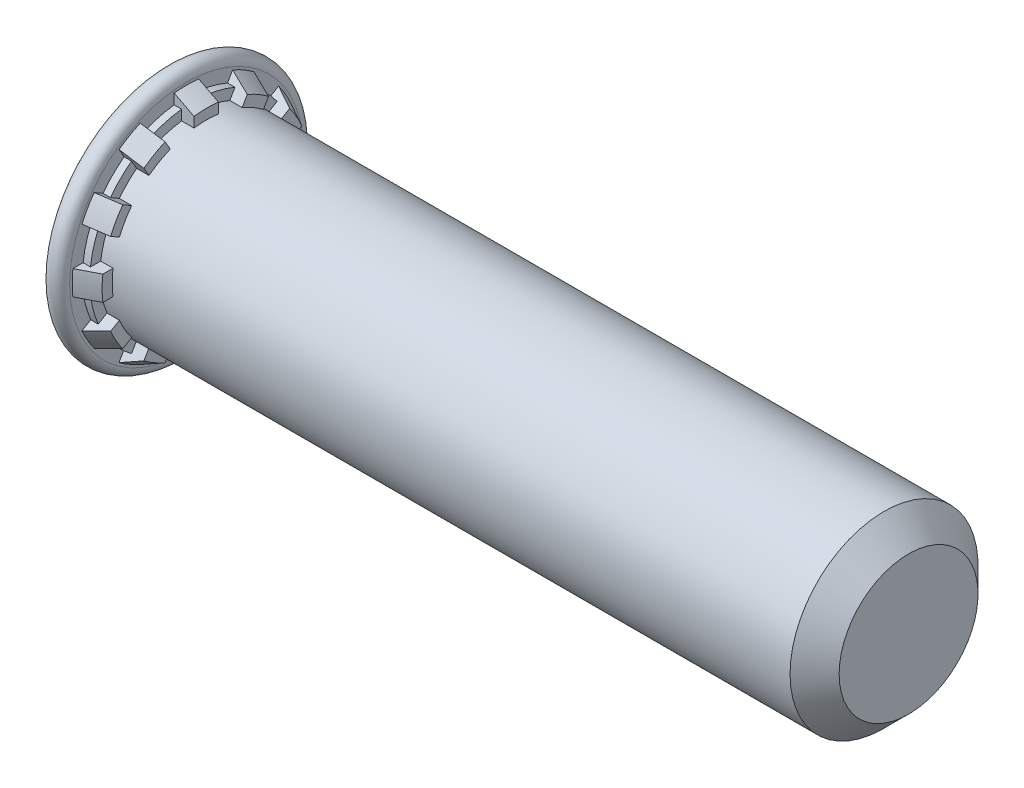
ISO-10303-21;
HEADER;
FILE_DESCRIPTION(('STEP AP214'),'2;1');
FILE_NAME('part.step','',(''),(''),'','','');
FILE_SCHEMA(('AUTOMOTIVE_DESIGN { 1 0 10303 214 1 1 1 1 }'));
ENDSEC;
DATA;
#1=APPLICATION_CONTEXT('core data for automotive mechanical design processes');
#2=APPLICATION_PROTOCOL_DEFINITION('international standard','automotive_design',2000,#1);
#3=PRODUCT_CONTEXT('',#1,'mechanical');
#4=PRODUCT('Part','Part','',(#3));
#5=PRODUCT_RELATED_PRODUCT_CATEGORY('part','',(#4));
#6=PRODUCT_DEFINITION_FORMATION('','',#4);
#7=PRODUCT_DEFINITION_CONTEXT('part definition',#1,'design');
#8=PRODUCT_DEFINITION('design','',#6,#7);
#9=PRODUCT_DEFINITION_SHAPE('','',#8);
#10=(LENGTH_UNIT() NAMED_UNIT(*) SI_UNIT(.MILLI.,.METRE.));
#11=(NAMED_UNIT(*) PLANE_ANGLE_UNIT() SI_UNIT($,.RADIAN.));
#12=(NAMED_UNIT(*) SI_UNIT($,.STERADIAN.) SOLID_ANGLE_UNIT());
#13=UNCERTAINTY_MEASURE_WITH_UNIT(LENGTH_MEASURE(1.E-05),#10,'distance_accuracy_value','');
#14=(GEOMETRIC_REPRESENTATION_CONTEXT(3) GLOBAL_UNCERTAINTY_ASSIGNED_CONTEXT((#13)) GLOBAL_UNIT_ASSIGNED_CONTEXT((#10,
#11,#12)) REPRESENTATION_CONTEXT('',''));
#15=CARTESIAN_POINT('',(0.,0.,0.));
#16=DIRECTION('',(0.,0.,1.));
#17=DIRECTION('',(1.,0.,0.));
#18=AXIS2_PLACEMENT_3D('',#15,#16,#17);
#19=CARTESIAN_POINT('',(0.508,0.,0.));
#20=DIRECTION('',(-1.,0.,0.));
#21=DIRECTION('',(0.,0.,1.));
#22=AXIS2_PLACEMENT_3D('',#19,#20,#21);
#23=CONICAL_SURFACE('',#22,2.9337,0.473597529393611);
#24=CARTESIAN_POINT('',(0.508,0.,0.));
#25=DIRECTION('',(-1.,0.,0.));
#26=DIRECTION('',(0.,0.,1.));
#27=AXIS2_PLACEMENT_3D('',#24,#25,#26);
#28=CIRCLE('',#27,2.9337);
#29=CARTESIAN_POINT('',(0.508,1.7311351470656,-2.36849462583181));
#30=VERTEX_POINT('',#29);
#31=CARTESIAN_POINT('',(0.508,1.18560894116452,-2.6834543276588));
#32=VERTEX_POINT('',#31);
#33=EDGE_CURVE('E1044',#30,#32,#28,.T.);
#34=ORIENTED_EDGE('',*,*,#33,.F.);
#35=CARTESIAN_POINT('',(1.0162,1.60007736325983,-2.14149588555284));
#36=CARTESIAN_POINT('',(0.910241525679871,1.62741866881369,-2.18885241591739));
#37=CARTESIAN_POINT('',(0.804274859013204,1.65475203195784,-2.23619518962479));
#38=CARTESIAN_POINT('',(0.634802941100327,1.69845005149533,-2.31188237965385));
#39=CARTESIAN_POINT('',(0.571302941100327,1.71481979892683,-2.34023561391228));
#40=CARTESIAN_POINT('',(0.5078,1.73118669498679,-2.36858390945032));
#41=B_SPLINE_CURVE_WITH_KNOTS('',3,(#35,#36,#37,#38,#39,#40),.UNSPECIFIED.,.F.,.F.,(4,2,4),(0.,
0.357710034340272,0.572039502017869),.UNSPECIFIED.);
#42=CARTESIAN_POINT('',(1.016,1.60012897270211,-2.14158527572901));
#43=VERTEX_POINT('',#42);
#44=EDGE_CURVE('E655',#43,#30,#41,.T.);
#45=ORIENTED_EDGE('',*,*,#44,.F.);
#46=CARTESIAN_POINT('',(1.016,0.,0.));
#47=DIRECTION('',(-1.,0.,0.));
#48=DIRECTION('',(0.,0.,1.));
#49=AXIS2_PLACEMENT_3D('',#46,#47,#48);
#50=CIRCLE('',#49,2.67335);
#51=CARTESIAN_POINT('',(1.016,1.05460276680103,-2.456544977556));
#52=VERTEX_POINT('',#51);
#53=EDGE_CURVE('E1041',#43,#52,#50,.T.);
#54=ORIENTED_EDGE('',*,*,#53,.T.);
#55=CARTESIAN_POINT('',(0.5078,1.18566048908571,-2.68354361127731));
#56=CARTESIAN_POINT('',(0.571302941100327,1.16929359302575,-2.65519531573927));
#57=CARTESIAN_POINT('',(0.634802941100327,1.15292384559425,-2.62684208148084));
#58=CARTESIAN_POINT('',(0.804274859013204,1.10922582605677,-2.55115489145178));
#59=CARTESIAN_POINT('',(0.91024152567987,1.08189246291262,-2.50381211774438));
#60=CARTESIAN_POINT('',(1.0162,1.05455115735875,-2.45645558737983));
#61=B_SPLINE_CURVE_WITH_KNOTS('',3,(#55,#56,#57,#58,#59,#60),.UNSPECIFIED.,.F.,.F.,(4,2,4),(0.,
0.214329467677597,0.572039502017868),.UNSPECIFIED.);
#62=EDGE_CURVE('E695',#32,#52,#61,.T.);
#63=ORIENTED_EDGE('',*,*,#62,.F.);
#64=EDGE_LOOP('',(#34,#45,#54,#63));
#65=FACE_BOUND('',#64,.T.);
#66=ADVANCED_FACE('F32',(#65),#23,.T.);
#67=CARTESIAN_POINT('',(0.508,0.314959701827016,-2.91674408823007));
#68=VERTEX_POINT('',#67);
#69=CARTESIAN_POINT('',(0.508,-0.314959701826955,-2.91674408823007));
#70=VERTEX_POINT('',#69);
#71=EDGE_CURVE('E1271',#68,#70,#28,.T.);
#72=ORIENTED_EDGE('',*,*,#71,.F.);
#73=CARTESIAN_POINT('',(1.83467510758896,0.314959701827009,-2.23166310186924));
#74=CARTESIAN_POINT('',(1.47053556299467,0.314959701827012,-2.4200911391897));
#75=CARTESIAN_POINT('',(1.10624509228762,0.314959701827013,-2.60822694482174));
#76=CARTESIAN_POINT('',(0.37746257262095,0.314959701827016,-2.9841077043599));
#77=CARTESIAN_POINT('',(0.0129705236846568,0.314959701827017,-3.17185265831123));
#78=CARTESIAN_POINT('',(-0.379798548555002,0.314959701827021,-3.37402836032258));
#79=CARTESIAN_POINT('',(-0.408025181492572,0.314959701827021,-3.38855711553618));
#80=CARTESIAN_POINT('',(-0.436252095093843,0.314959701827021,-3.4030853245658));
#81=B_SPLINE_CURVE_WITH_KNOTS('',3,(#73,#74,#75,#76,#77,#78,#79,#80),.UNSPECIFIED.,.F.,.F.,(4,2,
2,4),(0.,1.23000951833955,2.46001889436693,2.55525779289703),.UNSPECIFIED.);
#82=CARTESIAN_POINT('',(1.016,0.314959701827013,-2.65473173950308));
#83=VERTEX_POINT('',#82);
#84=EDGE_CURVE('E703',#83,#68,#81,.T.);
#85=ORIENTED_EDGE('',*,*,#84,.F.);
#86=CARTESIAN_POINT('',(1.016,-0.314959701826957,-2.65473173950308));
#87=VERTEX_POINT('',#86);
#88=EDGE_CURVE('E1108',#83,#87,#50,.T.);
#89=ORIENTED_EDGE('',*,*,#88,.T.);
#90=CARTESIAN_POINT('',(-0.436252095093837,-0.314959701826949,-3.40308532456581));
#91=CARTESIAN_POINT('',(-0.408025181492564,-0.31495970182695,-3.38855711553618));
#92=CARTESIAN_POINT('',(-0.37979854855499,-0.31495970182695,-3.37402836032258));
#93=CARTESIAN_POINT('',(0.0129705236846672,-0.314959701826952,-3.17185265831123));
#94=CARTESIAN_POINT('',(0.377462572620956,-0.314959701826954,-2.9841077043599));
#95=CARTESIAN_POINT('',(1.10624509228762,-0.314959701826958,-2.60822694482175));
#96=CARTESIAN_POINT('',(1.47053556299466,-0.31495970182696,-2.42009113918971));
#97=CARTESIAN_POINT('',(1.83467510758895,-0.314959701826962,-2.23166310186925));
#98=B_SPLINE_CURVE_WITH_KNOTS('',3,(#90,#91,#92,#93,#94,#95,#96,#97),.UNSPECIFIED.,.F.,.F.,(4,2,
2,4),(0.,0.095238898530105,1.32524827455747,2.55525779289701),.UNSPECIFIED.);
#99=EDGE_CURVE('E731',#70,#87,#98,.T.);
#100=ORIENTED_EDGE('',*,*,#99,.F.);
#101=EDGE_LOOP('',(#72,#85,#89,#100));
#102=FACE_BOUND('',#101,.T.);
#103=ADVANCED_FACE('F1284',(#102),#23,.T.);
#104=CARTESIAN_POINT('',(0.508,-1.18560894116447,-2.68345432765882));
#105=VERTEX_POINT('',#104);
#106=CARTESIAN_POINT('',(0.508,-1.73113514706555,-2.36849462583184));
#107=VERTEX_POINT('',#106);
#108=EDGE_CURVE('E1268',#105,#107,#28,.T.);
#109=ORIENTED_EDGE('',*,*,#108,.F.);
#110=CARTESIAN_POINT('',(1.0162,-1.0545511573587,-2.45645558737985));
#111=CARTESIAN_POINT('',(0.91024152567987,-1.08189246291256,-2.50381211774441));
#112=CARTESIAN_POINT('',(0.804274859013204,-1.10922582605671,-2.55115489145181));
#113=CARTESIAN_POINT('',(0.634802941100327,-1.15292384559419,-2.62684208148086));
#114=CARTESIAN_POINT('',(0.571302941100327,-1.1692935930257,-2.65519531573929));
#115=CARTESIAN_POINT('',(0.507800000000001,-1.18566048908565,-2.68354361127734));
#116=B_SPLINE_CURVE_WITH_KNOTS('',3,(#110,#111,#112,#113,#114,#115),.UNSPECIFIED.,.F.,.F.,(4,2,
4),(0.,0.357710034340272,0.572039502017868),.UNSPECIFIED.);
#117=CARTESIAN_POINT('',(1.016,-1.05460276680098,-2.45654497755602));
#118=VERTEX_POINT('',#117);
#119=EDGE_CURVE('E724',#118,#105,#116,.T.);
#120=ORIENTED_EDGE('',*,*,#119,.F.);
#121=CARTESIAN_POINT('',(1.016,-1.60012897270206,-2.14158527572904));
#122=VERTEX_POINT('',#121);
#123=EDGE_CURVE('E1299',#118,#122,#50,.T.);
#124=ORIENTED_EDGE('',*,*,#123,.T.);
#125=CARTESIAN_POINT('',(0.5078,-1.73118669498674,-2.36858390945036));
#126=CARTESIAN_POINT('',(0.571302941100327,-1.71481979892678,-2.34023561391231));
#127=CARTESIAN_POINT('',(0.634802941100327,-1.69845005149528,-2.31188237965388));
#128=CARTESIAN_POINT('',(0.804274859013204,-1.6547520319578,-2.23619518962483));
#129=CARTESIAN_POINT('',(0.91024152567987,-1.62741866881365,-2.18885241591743));
#130=CARTESIAN_POINT('',(1.0162,-1.60007736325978,-2.14149588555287));
#131=B_SPLINE_CURVE_WITH_KNOTS('',3,(#125,#126,#127,#128,#129,#130),.UNSPECIFIED.,.F.,.F.,(4,2,
4),(0.,0.214329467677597,0.572039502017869),.UNSPECIFIED.);
#132=EDGE_CURVE('E758',#107,#122,#131,.T.);
#133=ORIENTED_EDGE('',*,*,#132,.F.);
#134=EDGE_LOOP('',(#109,#120,#124,#133));
#135=FACE_BOUND('',#134,.T.);
#136=ADVANCED_FACE('F1298',(#135),#23,.T.);
#137=CARTESIAN_POINT('',(0.508,-2.36849462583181,-1.73113514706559));
#138=VERTEX_POINT('',#137);
#139=CARTESIAN_POINT('',(0.508,-2.6834543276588,-1.18560894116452));
#140=VERTEX_POINT('',#139);
#141=EDGE_CURVE('E1265',#138,#140,#28,.T.);
#142=ORIENTED_EDGE('',*,*,#141,.F.);
#143=CARTESIAN_POINT('',(1.0162,-2.14149588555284,-1.60007736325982));
#144=CARTESIAN_POINT('',(0.91024152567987,-2.1888524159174,-1.62741866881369));
#145=CARTESIAN_POINT('',(0.804274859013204,-2.2361951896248,-1.65475203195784));
#146=CARTESIAN_POINT('',(0.634802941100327,-2.31188237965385,-1.69845005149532));
#147=CARTESIAN_POINT('',(0.571302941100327,-2.34023561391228,-1.71481979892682));
#148=CARTESIAN_POINT('',(0.507800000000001,-2.36858390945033,-1.73118669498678));
#149=B_SPLINE_CURVE_WITH_KNOTS('',3,(#143,#144,#145,#146,#147,#148),.UNSPECIFIED.,.F.,.F.,(4,2,
4),(0.,0.357710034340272,0.572039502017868),.UNSPECIFIED.);
#150=CARTESIAN_POINT('',(1.016,-2.14158527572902,-1.6001289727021));
#151=VERTEX_POINT('',#150);
#152=EDGE_CURVE('E766',#151,#138,#149,.T.);
#153=ORIENTED_EDGE('',*,*,#152,.F.);
#154=CARTESIAN_POINT('',(1.016,-2.45654497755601,-1.05460276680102));
#155=VERTEX_POINT('',#154);
#156=EDGE_CURVE('E1303',#151,#155,#50,.T.);
#157=ORIENTED_EDGE('',*,*,#156,.T.);
#158=CARTESIAN_POINT('',(0.507800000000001,-2.68354361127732,-1.1856604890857));
#159=CARTESIAN_POINT('',(0.571302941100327,-2.65519531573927,-1.16929359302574));
#160=CARTESIAN_POINT('',(0.634802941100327,-2.62684208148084,-1.15292384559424));
#161=CARTESIAN_POINT('',(0.804274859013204,-2.55115489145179,-1.10922582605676));
#162=CARTESIAN_POINT('',(0.910241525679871,-2.50381211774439,-1.08189246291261));
#163=CARTESIAN_POINT('',(1.0162,-2.45645558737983,-1.05455115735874));
#164=B_SPLINE_CURVE_WITH_KNOTS('',3,(#158,#159,#160,#161,#162,#163),.UNSPECIFIED.,.F.,.F.,(4,2,
4),(0.,0.214329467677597,0.572039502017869),.UNSPECIFIED.);
#165=EDGE_CURVE('E794',#140,#155,#164,.T.);
#166=ORIENTED_EDGE('',*,*,#165,.F.);
#167=EDGE_LOOP('',(#142,#153,#157,#166));
#168=FACE_BOUND('',#167,.T.);
#169=ADVANCED_FACE('F1457',(#168),#23,.T.);
#170=CARTESIAN_POINT('',(0.508,-2.91674408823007,-0.314959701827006));
#171=VERTEX_POINT('',#170);
#172=CARTESIAN_POINT('',(0.508,-2.91674408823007,0.314959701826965));
#173=VERTEX_POINT('',#172);
#174=EDGE_CURVE('E1262',#171,#173,#28,.T.);
#175=ORIENTED_EDGE('',*,*,#174,.F.);
#176=CARTESIAN_POINT('',(1.83467510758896,-2.23166310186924,-0.314959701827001));
#177=CARTESIAN_POINT('',(1.47053556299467,-2.42009113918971,-0.314959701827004));
#178=CARTESIAN_POINT('',(1.10624509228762,-2.60822694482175,-0.314959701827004));
#179=CARTESIAN_POINT('',(0.377462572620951,-2.9841077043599,-0.314959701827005));
#180=CARTESIAN_POINT('',(0.0129705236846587,-3.17185265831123,-0.314959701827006));
#181=CARTESIAN_POINT('',(-0.379798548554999,-3.37402836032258,-0.314959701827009));
#182=CARTESIAN_POINT('',(-0.40802518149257,-3.38855711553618,-0.314959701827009));
#183=CARTESIAN_POINT('',(-0.436252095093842,-3.4030853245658,-0.314959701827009));
#184=B_SPLINE_CURVE_WITH_KNOTS('',3,(#176,#177,#178,#179,#180,#181,#182,#183),.UNSPECIFIED.,.F.,
.F.,(4,2,2,4),(0.,1.23000951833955,2.46001889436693,2.55525779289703),.UNSPECIFIED.);
#185=CARTESIAN_POINT('',(1.016,-2.65473173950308,-0.314959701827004));
#186=VERTEX_POINT('',#185);
#187=EDGE_CURVE('E787',#186,#171,#184,.T.);
#188=ORIENTED_EDGE('',*,*,#187,.F.);
#189=CARTESIAN_POINT('',(1.016,-2.65473173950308,0.314959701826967));
#190=VERTEX_POINT('',#189);
#191=EDGE_CURVE('E1304',#186,#190,#50,.T.);
#192=ORIENTED_EDGE('',*,*,#191,.T.);
#193=CARTESIAN_POINT('',(-0.436252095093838,-3.40308532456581,0.314959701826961));
#194=CARTESIAN_POINT('',(-0.408025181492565,-3.38855711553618,0.314959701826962));
#195=CARTESIAN_POINT('',(-0.379798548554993,-3.37402836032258,0.314959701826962));
#196=CARTESIAN_POINT('',(0.0129705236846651,-3.17185265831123,0.314959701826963));
#197=CARTESIAN_POINT('',(0.377462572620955,-2.9841077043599,0.314959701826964));
#198=CARTESIAN_POINT('',(1.10624509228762,-2.60822694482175,0.314959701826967));
#199=CARTESIAN_POINT('',(1.47053556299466,-2.42009113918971,0.314959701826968));
#200=CARTESIAN_POINT('',(1.83467510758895,-2.23166310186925,0.31495970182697));
#201=B_SPLINE_CURVE_WITH_KNOTS('',3,(#193,#194,#195,#196,#197,#198,#199,#200),.UNSPECIFIED.,.F.,
.F.,(4,2,2,4),(0.,0.0952388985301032,1.32524827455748,2.55525779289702),.UNSPECIFIED.);
#202=EDGE_CURVE('E821',#173,#190,#201,.T.);
#203=ORIENTED_EDGE('',*,*,#202,.F.);
#204=EDGE_LOOP('',(#175,#188,#192,#203));
#205=FACE_BOUND('',#204,.T.);
#206=ADVANCED_FACE('F1454',(#205),#23,.T.);
#207=CARTESIAN_POINT('',(0.508,-2.68345432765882,1.18560894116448));
#208=VERTEX_POINT('',#207);
#209=CARTESIAN_POINT('',(0.508,-2.36849462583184,1.73113514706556));
#210=VERTEX_POINT('',#209);
#211=EDGE_CURVE('E1259',#208,#210,#28,.T.);
#212=ORIENTED_EDGE('',*,*,#211,.F.);
#213=CARTESIAN_POINT('',(1.0162,-2.45645558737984,1.05455115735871));
#214=CARTESIAN_POINT('',(0.910241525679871,-2.5038121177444,1.08189246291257));
#215=CARTESIAN_POINT('',(0.804274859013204,-2.5511548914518,1.10922582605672));
#216=CARTESIAN_POINT('',(0.634802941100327,-2.62684208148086,1.1529238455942));
#217=CARTESIAN_POINT('',(0.571302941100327,-2.65519531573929,1.16929359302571));
#218=CARTESIAN_POINT('',(0.5078,-2.68354361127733,1.18566048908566));
#219=B_SPLINE_CURVE_WITH_KNOTS('',3,(#213,#214,#215,#216,#217,#218),.UNSPECIFIED.,.F.,.F.,(4,2,
4),(0.,0.357710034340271,0.572039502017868),.UNSPECIFIED.);
#220=CARTESIAN_POINT('',(1.016,-2.45654497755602,1.05460276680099));
#221=VERTEX_POINT('',#220);
#222=EDGE_CURVE('E829',#221,#208,#219,.T.);
#223=ORIENTED_EDGE('',*,*,#222,.F.);
#224=CARTESIAN_POINT('',(1.016,-2.14158527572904,1.60012897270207));
#225=VERTEX_POINT('',#224);
#226=EDGE_CURVE('E1309',#221,#225,#50,.T.);
#227=ORIENTED_EDGE('',*,*,#226,.T.);
#228=CARTESIAN_POINT('',(0.5078,-2.36858390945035,1.73118669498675));
#229=CARTESIAN_POINT('',(0.571302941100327,-2.34023561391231,1.71481979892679));
#230=CARTESIAN_POINT('',(0.634802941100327,-2.31188237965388,1.69845005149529));
#231=CARTESIAN_POINT('',(0.804274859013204,-2.23619518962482,1.65475203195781));
#232=CARTESIAN_POINT('',(0.91024152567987,-2.18885241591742,1.62741866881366));
#233=CARTESIAN_POINT('',(1.0162,-2.14149588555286,1.60007736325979));
#234=B_SPLINE_CURVE_WITH_KNOTS('',3,(#228,#229,#230,#231,#232,#233),.UNSPECIFIED.,.F.,.F.,(4,2,
4),(0.,0.214329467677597,0.572039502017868),.UNSPECIFIED.);
#235=EDGE_CURVE('E857',#210,#225,#234,.T.);
#236=ORIENTED_EDGE('',*,*,#235,.F.);
#237=EDGE_LOOP('',(#212,#223,#227,#236));
#238=FACE_BOUND('',#237,.T.);
#239=ADVANCED_FACE('F1456',(#238),#23,.T.);
#240=CARTESIAN_POINT('',(0.508,-1.73113514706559,2.36849462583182));
#241=VERTEX_POINT('',#240);
#242=CARTESIAN_POINT('',(0.508,-1.18560894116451,2.68345432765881));
#243=VERTEX_POINT('',#242);
#244=EDGE_CURVE('E1256',#241,#243,#28,.T.);
#245=ORIENTED_EDGE('',*,*,#244,.F.);
#246=CARTESIAN_POINT('',(1.0162,-1.60007736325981,2.14149588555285));
#247=CARTESIAN_POINT('',(0.910241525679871,-1.62741866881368,2.1888524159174));
#248=CARTESIAN_POINT('',(0.804274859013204,-1.65475203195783,2.2361951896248));
#249=CARTESIAN_POINT('',(0.634802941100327,-1.69845005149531,2.31188237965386));
#250=CARTESIAN_POINT('',(0.571302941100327,-1.71481979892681,2.34023561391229));
#251=CARTESIAN_POINT('',(0.5078,-1.73118669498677,2.36858390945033));
#252=B_SPLINE_CURVE_WITH_KNOTS('',3,(#246,#247,#248,#249,#250,#251),.UNSPECIFIED.,.F.,.F.,(4,2,
4),(0.,0.357710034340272,0.572039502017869),.UNSPECIFIED.);
#253=CARTESIAN_POINT('',(1.016,-1.60012897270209,2.14158527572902));
#254=VERTEX_POINT('',#253);
#255=EDGE_CURVE('E850',#254,#241,#252,.T.);
#256=ORIENTED_EDGE('',*,*,#255,.F.);
#257=CARTESIAN_POINT('',(1.016,-1.05460276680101,2.45654497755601));
#258=VERTEX_POINT('',#257);
#259=EDGE_CURVE('E1313',#254,#258,#50,.T.);
#260=ORIENTED_EDGE('',*,*,#259,.T.);
#261=CARTESIAN_POINT('',(0.5078,-1.18566048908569,2.68354361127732));
#262=CARTESIAN_POINT('',(0.571302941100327,-1.16929359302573,2.65519531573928));
#263=CARTESIAN_POINT('',(0.634802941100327,-1.15292384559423,2.62684208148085));
#264=CARTESIAN_POINT('',(0.804274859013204,-1.10922582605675,2.55115489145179));
#265=CARTESIAN_POINT('',(0.91024152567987,-1.0818924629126,2.50381211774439));
#266=CARTESIAN_POINT('',(1.0162,-1.05455115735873,2.45645558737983));
#267=B_SPLINE_CURVE_WITH_KNOTS('',3,(#261,#262,#263,#264,#265,#266),.UNSPECIFIED.,.F.,.F.,(4,2,
4),(0.,0.214329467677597,0.572039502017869),.UNSPECIFIED.);
#268=EDGE_CURVE('E884',#243,#258,#267,.T.);
#269=ORIENTED_EDGE('',*,*,#268,.F.);
#270=EDGE_LOOP('',(#245,#256,#260,#269));
#271=FACE_BOUND('',#270,.T.);
#272=ADVANCED_FACE('F1370',(#271),#23,.T.);
#273=CARTESIAN_POINT('',(0.508,-0.314959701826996,2.91674408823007));
#274=VERTEX_POINT('',#273);
#275=CARTESIAN_POINT('',(0.508,0.314959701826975,2.91674408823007));
#276=VERTEX_POINT('',#275);
#277=EDGE_CURVE('E1253',#274,#276,#28,.T.);
#278=ORIENTED_EDGE('',*,*,#277,.F.);
#279=CARTESIAN_POINT('',(2.07015721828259,-0.314959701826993,2.10971377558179));
#280=CARTESIAN_POINT('',(1.70610188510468,-0.314959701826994,2.29830465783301));
#281=CARTESIAN_POINT('',(1.34187196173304,-0.314959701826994,2.48655773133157));
#282=CARTESIAN_POINT('',(0.613180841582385,-0.314959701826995,2.86261570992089));
#283=CARTESIAN_POINT('',(0.248719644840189,-0.314959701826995,3.05042061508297));
#284=CARTESIAN_POINT('',(-0.170209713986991,-0.314959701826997,3.26613227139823));
#285=CARTESIAN_POINT('',(-0.224622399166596,-0.314959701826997,3.2941468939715));
#286=CARTESIAN_POINT('',(-0.27903615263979,-0.314959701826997,3.32215943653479));
#287=B_SPLINE_CURVE_WITH_KNOTS('',3,(#279,#280,#281,#282,#283,#284,#285,#286),.UNSPECIFIED.,.F.,
.F.,(4,2,2,4),(0.,1.23000960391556,2.46001901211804,2.64362193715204),.UNSPECIFIED.);
#288=CARTESIAN_POINT('',(1.016,-0.314959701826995,2.65473173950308));
#289=VERTEX_POINT('',#288);
#290=EDGE_CURVE('E892',#289,#274,#287,.T.);
#291=ORIENTED_EDGE('',*,*,#290,.F.);
#292=CARTESIAN_POINT('',(1.016,0.314959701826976,2.65473173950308));
#293=VERTEX_POINT('',#292);
#294=EDGE_CURVE('E1215',#289,#293,#50,.T.);
#295=ORIENTED_EDGE('',*,*,#294,.T.);
#296=CARTESIAN_POINT('',(-0.279036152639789,0.314959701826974,3.32215943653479));
#297=CARTESIAN_POINT('',(-0.224622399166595,0.314959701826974,3.2941468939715));
#298=CARTESIAN_POINT('',(-0.170209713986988,0.314959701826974,3.26613227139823));
#299=CARTESIAN_POINT('',(0.248719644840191,0.314959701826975,3.05042061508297));
#300=CARTESIAN_POINT('',(0.613180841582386,0.314959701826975,2.86261570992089));
#301=CARTESIAN_POINT('',(1.34187196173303,0.314959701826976,2.48655773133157));
#302=CARTESIAN_POINT('',(1.70610188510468,0.314959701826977,2.29830465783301));
#303=CARTESIAN_POINT('',(2.07015721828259,0.314959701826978,2.10971377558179));
#304=B_SPLINE_CURVE_WITH_KNOTS('',3,(#296,#297,#298,#299,#300,#301,#302,#303),.UNSPECIFIED.,.F.,
.F.,(4,2,2,4),(0.,0.183602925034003,1.41361233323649,2.64362193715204),.UNSPECIFIED.);
#305=EDGE_CURVE('E920',#276,#293,#304,.T.);
#306=ORIENTED_EDGE('',*,*,#305,.F.);
#307=EDGE_LOOP('',(#278,#291,#295,#306));
#308=FACE_BOUND('',#307,.T.);
#309=ADVANCED_FACE('F1325',(#308),#23,.T.);
#310=CARTESIAN_POINT('',(0.508,1.18560894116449,2.68345432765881));
#311=VERTEX_POINT('',#310);
#312=CARTESIAN_POINT('',(0.508,1.73113514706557,2.36849462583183));
#313=VERTEX_POINT('',#312);
#314=EDGE_CURVE('E1252',#311,#313,#28,.T.);
#315=ORIENTED_EDGE('',*,*,#314,.F.);
#316=CARTESIAN_POINT('',(1.0162,1.05455115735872,2.45645558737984));
#317=CARTESIAN_POINT('',(0.910241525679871,1.08189246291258,2.5038121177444));
#318=CARTESIAN_POINT('',(0.804274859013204,1.10922582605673,2.5511548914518));
#319=CARTESIAN_POINT('',(0.634802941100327,1.15292384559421,2.62684208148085));
#320=CARTESIAN_POINT('',(0.571302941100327,1.16929359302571,2.65519531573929));
#321=CARTESIAN_POINT('',(0.5078,1.18566048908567,2.68354361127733));
#322=B_SPLINE_CURVE_WITH_KNOTS('',3,(#316,#317,#318,#319,#320,#321),.UNSPECIFIED.,.F.,.F.,(4,2,
4),(0.,0.357710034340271,0.572039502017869),.UNSPECIFIED.);
#323=CARTESIAN_POINT('',(1.016,1.05460276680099,2.45654497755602));
#324=VERTEX_POINT('',#323);
#325=EDGE_CURVE('E913',#324,#311,#322,.T.);
#326=ORIENTED_EDGE('',*,*,#325,.F.);
#327=CARTESIAN_POINT('',(1.016,1.60012897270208,2.14158527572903));
#328=VERTEX_POINT('',#327);
#329=EDGE_CURVE('E1214',#324,#328,#50,.T.);
#330=ORIENTED_EDGE('',*,*,#329,.T.);
#331=CARTESIAN_POINT('',(0.5078,1.73118669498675,2.36858390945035));
#332=CARTESIAN_POINT('',(0.571302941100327,1.7148197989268,2.3402356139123));
#333=CARTESIAN_POINT('',(0.634802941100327,1.6984500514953,2.31188237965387));
#334=CARTESIAN_POINT('',(0.804274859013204,1.65475203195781,2.23619518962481));
#335=CARTESIAN_POINT('',(0.910241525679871,1.62741866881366,2.18885241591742));
#336=CARTESIAN_POINT('',(1.0162,1.6000773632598,2.14149588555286));
#337=B_SPLINE_CURVE_WITH_KNOTS('',3,(#331,#332,#333,#334,#335,#336),.UNSPECIFIED.,.F.,.F.,(4,2,
4),(0.,0.214329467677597,0.572039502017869),.UNSPECIFIED.);
#338=EDGE_CURVE('E947',#313,#328,#337,.T.);
#339=ORIENTED_EDGE('',*,*,#338,.F.);
#340=EDGE_LOOP('',(#315,#326,#330,#339));
#341=FACE_BOUND('',#340,.T.);
#342=ADVANCED_FACE('F1362',(#341),#23,.T.);
#343=CARTESIAN_POINT('',(0.508,2.36849462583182,1.73113514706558));
#344=VERTEX_POINT('',#343);
#345=CARTESIAN_POINT('',(0.508,2.68345432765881,1.1856089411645));
#346=VERTEX_POINT('',#345);
#347=EDGE_CURVE('E1249',#344,#346,#28,.T.);
#348=ORIENTED_EDGE('',*,*,#347,.F.);
#349=CARTESIAN_POINT('',(1.0162,2.14149588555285,1.60007736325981));
#350=CARTESIAN_POINT('',(0.91024152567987,2.18885241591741,1.62741866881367));
#351=CARTESIAN_POINT('',(0.804274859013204,2.23619518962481,1.65475203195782));
#352=CARTESIAN_POINT('',(0.634802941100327,2.31188237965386,1.6984500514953));
#353=CARTESIAN_POINT('',(0.571302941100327,2.3402356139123,1.71481979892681));
#354=CARTESIAN_POINT('',(0.5078,2.36858390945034,1.73118669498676));
#355=B_SPLINE_CURVE_WITH_KNOTS('',3,(#349,#350,#351,#352,#353,#354),.UNSPECIFIED.,.F.,.F.,(4,2,
4),(0.,0.357710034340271,0.572039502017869),.UNSPECIFIED.);
#356=CARTESIAN_POINT('',(1.016,2.14158527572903,1.60012897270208));
#357=VERTEX_POINT('',#356);
#358=EDGE_CURVE('E955',#357,#344,#355,.T.);
#359=ORIENTED_EDGE('',*,*,#358,.F.);
#360=CARTESIAN_POINT('',(1.016,2.45654497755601,1.054602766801));
#361=VERTEX_POINT('',#360);
#362=EDGE_CURVE('E1211',#357,#361,#50,.T.);
#363=ORIENTED_EDGE('',*,*,#362,.T.);
#364=CARTESIAN_POINT('',(0.5078,2.68354361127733,1.18566048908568));
#365=CARTESIAN_POINT('',(0.571302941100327,2.65519531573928,1.16929359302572));
#366=CARTESIAN_POINT('',(0.634802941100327,2.62684208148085,1.15292384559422));
#367=CARTESIAN_POINT('',(0.804274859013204,2.55115489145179,1.10922582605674));
#368=CARTESIAN_POINT('',(0.91024152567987,2.5038121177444,1.08189246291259));
#369=CARTESIAN_POINT('',(1.0162,2.45645558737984,1.05455115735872));
#370=B_SPLINE_CURVE_WITH_KNOTS('',3,(#364,#365,#366,#367,#368,#369),.UNSPECIFIED.,.F.,.F.,(4,2,
4),(0.,0.214329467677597,0.572039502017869),.UNSPECIFIED.);
#371=EDGE_CURVE('E983',#346,#361,#370,.T.);
#372=ORIENTED_EDGE('',*,*,#371,.F.);
#373=EDGE_LOOP('',(#348,#359,#363,#372));
#374=FACE_BOUND('',#373,.T.);
#375=ADVANCED_FACE('F1251',(#374),#23,.T.);
#376=CARTESIAN_POINT('',(0.508,2.91674408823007,0.314959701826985));
#377=VERTEX_POINT('',#376);
#378=CARTESIAN_POINT('',(0.508,2.91674408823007,-0.314959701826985));
#379=VERTEX_POINT('',#378);
#380=EDGE_CURVE('E1040',#377,#379,#28,.T.);
#381=ORIENTED_EDGE('',*,*,#380,.F.);
#382=CARTESIAN_POINT('',(2.07015721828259,2.10971377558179,0.314959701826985));
#383=CARTESIAN_POINT('',(1.70610188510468,2.29830465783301,0.314959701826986));
#384=CARTESIAN_POINT('',(1.34187196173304,2.48655773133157,0.314959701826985));
#385=CARTESIAN_POINT('',(0.613180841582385,2.86261570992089,0.314959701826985));
#386=CARTESIAN_POINT('',(0.248719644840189,3.05042061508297,0.314959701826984));
#387=CARTESIAN_POINT('',(-0.17020971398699,3.26613227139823,0.314959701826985));
#388=CARTESIAN_POINT('',(-0.224622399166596,3.2941468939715,0.314959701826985));
#389=CARTESIAN_POINT('',(-0.27903615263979,3.32215943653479,0.314959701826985));
#390=B_SPLINE_CURVE_WITH_KNOTS('',3,(#382,#383,#384,#385,#386,#387,#388,#389),.UNSPECIFIED.,.F.,
.F.,(4,2,2,4),(0.,1.23000960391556,2.46001901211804,2.64362193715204),.UNSPECIFIED.);
#391=CARTESIAN_POINT('',(1.016,2.65473173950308,0.314959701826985));
#392=VERTEX_POINT('',#391);
#393=EDGE_CURVE('E976',#392,#377,#390,.T.);
#394=ORIENTED_EDGE('',*,*,#393,.F.);
#395=CARTESIAN_POINT('',(1.016,2.65473173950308,-0.314959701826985));
#396=VERTEX_POINT('',#395);
#397=EDGE_CURVE('E1036',#392,#396,#50,.T.);
#398=ORIENTED_EDGE('',*,*,#397,.T.);
#399=CARTESIAN_POINT('',(-0.27903615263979,3.32215943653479,-0.314959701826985));
#400=CARTESIAN_POINT('',(-0.224622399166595,3.2941468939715,-0.314959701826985));
#401=CARTESIAN_POINT('',(-0.170209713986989,3.26613227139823,-0.314959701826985));
#402=CARTESIAN_POINT('',(0.24871964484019,3.05042061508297,-0.314959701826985));
#403=CARTESIAN_POINT('',(0.613180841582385,2.86261570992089,-0.314959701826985));
#404=CARTESIAN_POINT('',(1.34187196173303,2.48655773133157,-0.314959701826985));
#405=CARTESIAN_POINT('',(1.70610188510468,2.29830465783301,-0.314959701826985));
#406=CARTESIAN_POINT('',(2.07015721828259,2.10971377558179,-0.314959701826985));
#407=B_SPLINE_CURVE_WITH_KNOTS('',3,(#399,#400,#401,#402,#403,#404,#405,#406),.UNSPECIFIED.,.F.,
.F.,(4,2,2,4),(0.,0.183602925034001,1.41361233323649,2.64362193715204),.UNSPECIFIED.);
#408=EDGE_CURVE('E1014',#379,#396,#407,.T.);
#409=ORIENTED_EDGE('',*,*,#408,.F.);
#410=EDGE_LOOP('',(#381,#394,#398,#409));
#411=FACE_BOUND('',#410,.T.);
#412=ADVANCED_FACE('F1219',(#411),#23,.T.);
#413=CARTESIAN_POINT('',(1.016,2.67335,0.));
#414=DIRECTION('',(1.,0.,0.));
#415=DIRECTION('',(0.,0.,-1.));
#416=AXIS2_PLACEMENT_3D('',#413,#414,#415);
#417=PLANE('',#416);
#418=DIRECTION('',(0.,-0.866025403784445,0.499999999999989));
#419=VECTOR('',#418,1.);
#420=CARTESIAN_POINT('',(1.016,1.91436161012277,-1.46894132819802));
#421=LINE('',#420,#419);
#422=CARTESIAN_POINT('',(1.016,2.14158527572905,-1.60012897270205));
#423=VERTEX_POINT('',#422);
#424=CARTESIAN_POINT('',(1.016,1.91436161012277,-1.46894132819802));
#425=VERTEX_POINT('',#424);
#426=EDGE_CURVE('E647',#423,#425,#421,.T.);
#427=ORIENTED_EDGE('',*,*,#426,.F.);
#428=CARTESIAN_POINT('',(1.016,2.45654497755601,-1.054602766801));
#429=VERTEX_POINT('',#428);
#430=EDGE_CURVE('E1037',#429,#423,#50,.T.);
#431=ORIENTED_EDGE('',*,*,#430,.F.);
#432=DIRECTION('',(0.,0.866025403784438,-0.500000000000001));
#433=VECTOR('',#432,1.);
#434=CARTESIAN_POINT('',(1.016,2.22932131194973,-0.923415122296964));
#435=LINE('',#434,#433);
#436=CARTESIAN_POINT('',(1.016,2.22932131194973,-0.923415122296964));
#437=VERTEX_POINT('',#436);
#438=EDGE_CURVE('E1175',#437,#429,#435,.T.);
#439=ORIENTED_EDGE('',*,*,#438,.F.);
#440=CARTESIAN_POINT('',(1.016,0.,0.));
#441=DIRECTION('',(-1.,0.,0.));
#442=DIRECTION('',(0.,0.,1.));
#443=AXIS2_PLACEMENT_3D('',#440,#441,#442);
#444=CIRCLE('',#443,2.413);
#445=EDGE_CURVE('E1033',#437,#425,#444,.T.);
#446=ORIENTED_EDGE('',*,*,#445,.T.);
#447=EDGE_LOOP('',(#427,#431,#439,#446));
#448=FACE_BOUND('',#447,.T.);
#449=ADVANCED_FACE('F1352',(#448),#417,.T.);
#450=DIRECTION('',(0.,0.50000000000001,-0.866025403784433));
#451=VECTOR('',#450,1.);
#452=CARTESIAN_POINT('',(1.016,1.46894132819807,-1.91436161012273));
#453=LINE('',#452,#451);
#454=CARTESIAN_POINT('',(1.016,1.46894132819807,-1.91436161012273));
#455=VERTEX_POINT('',#454);
#456=EDGE_CURVE('E641',#455,#43,#453,.T.);
#457=ORIENTED_EDGE('',*,*,#456,.F.);
#458=CARTESIAN_POINT('',(1.016,0.923415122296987,-2.22932131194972));
#459=VERTEX_POINT('',#458);
#460=EDGE_CURVE('E55',#455,#459,#444,.T.);
#461=ORIENTED_EDGE('',*,*,#460,.T.);
#462=DIRECTION('',(0.,-0.50000000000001,0.866025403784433));
#463=VECTOR('',#462,1.);
#464=CARTESIAN_POINT('',(1.016,0.923415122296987,-2.22932131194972));
#465=LINE('',#464,#463);
#466=EDGE_CURVE('E1093',#52,#459,#465,.T.);
#467=ORIENTED_EDGE('',*,*,#466,.F.);
#468=ORIENTED_EDGE('',*,*,#53,.F.);
#469=EDGE_LOOP('',(#457,#461,#467,#468));
#470=FACE_BOUND('',#469,.T.);
#471=ADVANCED_FACE('F1360',(#470),#417,.T.);
#472=DIRECTION('',(0.,0.,-1.));
#473=VECTOR('',#472,1.);
#474=CARTESIAN_POINT('',(1.016,0.31495970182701,-2.392356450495));
#475=LINE('',#474,#473);
#476=CARTESIAN_POINT('',(1.016,0.31495970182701,-2.392356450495));
#477=VERTEX_POINT('',#476);
#478=EDGE_CURVE('E1095',#477,#83,#475,.T.);
#479=ORIENTED_EDGE('',*,*,#478,.F.);
#480=CARTESIAN_POINT('',(1.016,-0.31495970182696,-2.39235645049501));
#481=VERTEX_POINT('',#480);
#482=EDGE_CURVE('E1107',#477,#481,#444,.T.);
#483=ORIENTED_EDGE('',*,*,#482,.T.);
#484=DIRECTION('',(0.,0.,1.));
#485=VECTOR('',#484,1.);
#486=CARTESIAN_POINT('',(1.016,-0.31495970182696,-2.39235645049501));
#487=LINE('',#486,#485);
#488=EDGE_CURVE('E712',#87,#481,#487,.T.);
#489=ORIENTED_EDGE('',*,*,#488,.F.);
#490=ORIENTED_EDGE('',*,*,#88,.F.);
#491=EDGE_LOOP('',(#479,#483,#489,#490));
#492=FACE_BOUND('',#491,.T.);
#493=ADVANCED_FACE('F1105',(#492),#417,.T.);
#494=DIRECTION('',(0.,-0.499999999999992,-0.866025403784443));
#495=VECTOR('',#494,1.);
#496=CARTESIAN_POINT('',(1.016,-0.92341512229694,-2.22932131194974));
#497=LINE('',#496,#495);
#498=CARTESIAN_POINT('',(1.016,-0.92341512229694,-2.22932131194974));
#499=VERTEX_POINT('',#498);
#500=EDGE_CURVE('E702',#499,#118,#497,.T.);
#501=ORIENTED_EDGE('',*,*,#500,.F.);
#502=CARTESIAN_POINT('',(1.016,-1.46894132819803,-1.91436161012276));
#503=VERTEX_POINT('',#502);
#504=EDGE_CURVE('E1112',#499,#503,#444,.T.);
#505=ORIENTED_EDGE('',*,*,#504,.T.);
#506=DIRECTION('',(0.,0.499999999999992,0.866025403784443));
#507=VECTOR('',#506,1.);
#508=CARTESIAN_POINT('',(1.016,-1.46894132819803,-1.91436161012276));
#509=LINE('',#508,#507);
#510=EDGE_CURVE('E1302',#122,#503,#509,.T.);
#511=ORIENTED_EDGE('',*,*,#510,.F.);
#512=ORIENTED_EDGE('',*,*,#123,.F.);
#513=EDGE_LOOP('',(#501,#505,#511,#512));
#514=FACE_BOUND('',#513,.T.);
#515=ADVANCED_FACE('F1300',(#514),#417,.T.);
#516=DIRECTION('',(0.,-0.866025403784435,-0.500000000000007));
#517=VECTOR('',#516,1.);
#518=CARTESIAN_POINT('',(1.016,-1.91436161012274,-1.46894132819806));
#519=LINE('',#518,#517);
#520=CARTESIAN_POINT('',(1.016,-1.91436161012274,-1.46894132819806));
#521=VERTEX_POINT('',#520);
#522=EDGE_CURVE('E1288',#521,#151,#519,.T.);
#523=ORIENTED_EDGE('',*,*,#522,.F.);
#524=CARTESIAN_POINT('',(1.016,-2.22932131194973,-0.923415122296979));
#525=VERTEX_POINT('',#524);
#526=EDGE_CURVE('E1113',#521,#525,#444,.T.);
#527=ORIENTED_EDGE('',*,*,#526,.T.);
#528=DIRECTION('',(0.,0.866025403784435,0.500000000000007));
#529=VECTOR('',#528,1.);
#530=CARTESIAN_POINT('',(1.016,-2.22932131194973,-0.923415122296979));
#531=LINE('',#530,#529);
#532=EDGE_CURVE('E775',#155,#525,#531,.T.);
#533=ORIENTED_EDGE('',*,*,#532,.F.);
#534=ORIENTED_EDGE('',*,*,#156,.F.);
#535=EDGE_LOOP('',(#523,#527,#533,#534));
#536=FACE_BOUND('',#535,.T.);
#537=ADVANCED_FACE('F1401',(#536),#417,.T.);
#538=DIRECTION('',(0.,-1.,0.));
#539=VECTOR('',#538,1.);
#540=CARTESIAN_POINT('',(1.016,-2.392356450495,-0.314959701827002));
#541=LINE('',#540,#539);
#542=CARTESIAN_POINT('',(1.016,-2.392356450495,-0.314959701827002));
#543=VERTEX_POINT('',#542);
#544=EDGE_CURVE('E765',#543,#186,#541,.T.);
#545=ORIENTED_EDGE('',*,*,#544,.F.);
#546=CARTESIAN_POINT('',(1.016,-2.39235645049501,0.314959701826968));
#547=VERTEX_POINT('',#546);
#548=EDGE_CURVE('E1119',#543,#547,#444,.T.);
#549=ORIENTED_EDGE('',*,*,#548,.T.);
#550=DIRECTION('',(0.,1.,0.));
#551=VECTOR('',#550,1.);
#552=CARTESIAN_POINT('',(1.016,-2.39235645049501,0.314959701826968));
#553=LINE('',#552,#551);
#554=EDGE_CURVE('E1421',#190,#547,#553,.T.);
#555=ORIENTED_EDGE('',*,*,#554,.F.);
#556=ORIENTED_EDGE('',*,*,#191,.F.);
#557=EDGE_LOOP('',(#545,#549,#555,#556));
#558=FACE_BOUND('',#557,.T.);
#559=ADVANCED_FACE('F1405',(#558),#417,.T.);
#560=DIRECTION('',(0.,-0.866025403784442,0.499999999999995));
#561=VECTOR('',#560,1.);
#562=CARTESIAN_POINT('',(1.016,-2.22932131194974,0.923415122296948));
#563=LINE('',#562,#561);
#564=CARTESIAN_POINT('',(1.016,-2.22932131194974,0.923415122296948));
#565=VERTEX_POINT('',#564);
#566=EDGE_CURVE('E1420',#565,#221,#563,.T.);
#567=ORIENTED_EDGE('',*,*,#566,.F.);
#568=CARTESIAN_POINT('',(1.016,-1.91436161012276,1.46894132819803));
#569=VERTEX_POINT('',#568);
#570=EDGE_CURVE('E1124',#565,#569,#444,.T.);
#571=ORIENTED_EDGE('',*,*,#570,.T.);
#572=DIRECTION('',(0.,0.866025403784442,-0.499999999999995));
#573=VECTOR('',#572,1.);
#574=CARTESIAN_POINT('',(1.016,-1.91436161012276,1.46894132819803));
#575=LINE('',#574,#573);
#576=EDGE_CURVE('E838',#225,#569,#575,.T.);
#577=ORIENTED_EDGE('',*,*,#576,.F.);
#578=ORIENTED_EDGE('',*,*,#226,.F.);
#579=EDGE_LOOP('',(#567,#571,#577,#578));
#580=FACE_BOUND('',#579,.T.);
#581=ADVANCED_FACE('F1340',(#580),#417,.T.);
#582=DIRECTION('',(0.,-0.500000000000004,0.866025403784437));
#583=VECTOR('',#582,1.);
#584=CARTESIAN_POINT('',(1.016,-1.46894132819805,1.91436161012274));
#585=LINE('',#584,#583);
#586=CARTESIAN_POINT('',(1.016,-1.46894132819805,1.91436161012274));
#587=VERTEX_POINT('',#586);
#588=EDGE_CURVE('E828',#587,#254,#585,.T.);
#589=ORIENTED_EDGE('',*,*,#588,.F.);
#590=CARTESIAN_POINT('',(1.016,-0.923415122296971,2.22932131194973));
#591=VERTEX_POINT('',#590);
#592=EDGE_CURVE('E1130',#587,#591,#444,.T.);
#593=ORIENTED_EDGE('',*,*,#592,.T.);
#594=DIRECTION('',(0.,0.500000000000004,-0.866025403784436));
#595=VECTOR('',#594,1.);
#596=CARTESIAN_POINT('',(1.016,-0.923415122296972,2.22932131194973));
#597=LINE('',#596,#595);
#598=EDGE_CURVE('E1520',#258,#591,#597,.T.);
#599=ORIENTED_EDGE('',*,*,#598,.F.);
#600=ORIENTED_EDGE('',*,*,#259,.F.);
#601=EDGE_LOOP('',(#589,#593,#599,#600));
#602=FACE_BOUND('',#601,.T.);
#603=ADVANCED_FACE('F1335',(#602),#417,.T.);
#604=DIRECTION('',(0.,0.,1.));
#605=VECTOR('',#604,1.);
#606=CARTESIAN_POINT('',(1.016,-0.314959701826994,2.392356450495));
#607=LINE('',#606,#605);
#608=CARTESIAN_POINT('',(1.016,-0.314959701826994,2.392356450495));
#609=VERTEX_POINT('',#608);
#610=EDGE_CURVE('E1332',#609,#289,#607,.T.);
#611=ORIENTED_EDGE('',*,*,#610,.F.);
#612=CARTESIAN_POINT('',(1.016,0.314959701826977,2.39235645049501));
#613=VERTEX_POINT('',#612);
#614=EDGE_CURVE('E1135',#609,#613,#444,.T.);
#615=ORIENTED_EDGE('',*,*,#614,.T.);
#616=DIRECTION('',(0.,0.,-1.));
#617=VECTOR('',#616,1.);
#618=CARTESIAN_POINT('',(1.016,0.314959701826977,2.39235645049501));
#619=LINE('',#618,#617);
#620=EDGE_CURVE('E901',#293,#613,#619,.T.);
#621=ORIENTED_EDGE('',*,*,#620,.F.);
#622=ORIENTED_EDGE('',*,*,#294,.F.);
#623=EDGE_LOOP('',(#611,#615,#621,#622));
#624=FACE_BOUND('',#623,.T.);
#625=ADVANCED_FACE('F1331',(#624),#417,.T.);
#626=DIRECTION('',(0.,0.499999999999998,0.86602540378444));
#627=VECTOR('',#626,1.);
#628=CARTESIAN_POINT('',(1.016,0.923415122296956,2.22932131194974));
#629=LINE('',#628,#627);
#630=CARTESIAN_POINT('',(1.016,0.923415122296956,2.22932131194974));
#631=VERTEX_POINT('',#630);
#632=EDGE_CURVE('E891',#631,#324,#629,.T.);
#633=ORIENTED_EDGE('',*,*,#632,.F.);
#634=CARTESIAN_POINT('',(1.016,1.46894132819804,1.91436161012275));
#635=VERTEX_POINT('',#634);
#636=EDGE_CURVE('E1141',#631,#635,#444,.T.);
#637=ORIENTED_EDGE('',*,*,#636,.T.);
#638=DIRECTION('',(0.,-0.499999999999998,-0.86602540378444));
#639=VECTOR('',#638,1.);
#640=CARTESIAN_POINT('',(1.016,1.46894132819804,1.91436161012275));
#641=LINE('',#640,#639);
#642=EDGE_CURVE('E1243',#328,#635,#641,.T.);
#643=ORIENTED_EDGE('',*,*,#642,.F.);
#644=ORIENTED_EDGE('',*,*,#329,.F.);
#645=EDGE_LOOP('',(#633,#637,#643,#644));
#646=FACE_BOUND('',#645,.T.);
#647=ADVANCED_FACE('F1334',(#646),#417,.T.);
#648=DIRECTION('',(0.,0.866025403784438,0.500000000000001));
#649=VECTOR('',#648,1.);
#650=CARTESIAN_POINT('',(1.016,1.91436161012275,1.46894132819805));
#651=LINE('',#650,#649);
#652=CARTESIAN_POINT('',(1.016,1.91436161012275,1.46894132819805));
#653=VERTEX_POINT('',#652);
#654=EDGE_CURVE('E1212',#653,#357,#651,.T.);
#655=ORIENTED_EDGE('',*,*,#654,.F.);
#656=CARTESIAN_POINT('',(1.016,2.22932131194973,0.923415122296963));
#657=VERTEX_POINT('',#656);
#658=EDGE_CURVE('E1146',#653,#657,#444,.T.);
#659=ORIENTED_EDGE('',*,*,#658,.T.);
#660=DIRECTION('',(0.,-0.866025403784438,-0.500000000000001));
#661=VECTOR('',#660,1.);
#662=CARTESIAN_POINT('',(1.016,2.22932131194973,0.923415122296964));
#663=LINE('',#662,#661);
#664=EDGE_CURVE('E964',#361,#657,#663,.T.);
#665=ORIENTED_EDGE('',*,*,#664,.F.);
#666=ORIENTED_EDGE('',*,*,#362,.F.);
#667=EDGE_LOOP('',(#655,#659,#665,#666));
#668=FACE_BOUND('',#667,.T.);
#669=ADVANCED_FACE('F1210',(#668),#417,.T.);
#670=CARTESIAN_POINT('',(0.,0.,0.));
#671=DIRECTION('',(-1.,0.,0.));
#672=DIRECTION('',(0.,0.,1.));
#673=AXIS2_PLACEMENT_3D('',#670,#671,#672);
#674=PLANE('',#673);
#675=CARTESIAN_POINT('',(0.,0.,0.));
#676=DIRECTION('',(-1.,0.,0.));
#677=DIRECTION('',(0.,0.,1.));
#678=AXIS2_PLACEMENT_3D('',#675,#676,#677);
#679=CIRCLE('',#678,2.99466);
#680=CARTESIAN_POINT('',(0.,0.,2.99466));
#681=VERTEX_POINT('',#680);
#682=EDGE_CURVE('E1053',#681,#681,#679,.T.);
#683=ORIENTED_EDGE('',*,*,#682,.T.);
#684=EDGE_LOOP('',(#683));
#685=FACE_BOUND('',#684,.T.);
#686=ADVANCED_FACE('F34',(#685),#674,.T.);
#687=CARTESIAN_POINT('',(0.,0.,0.));
#688=DIRECTION('',(-1.,0.,0.));
#689=DIRECTION('',(0.,0.,1.));
#690=AXIS2_PLACEMENT_3D('',#687,#688,#689);
#691=CYLINDRICAL_SURFACE('',#690,2.99466);
#692=CARTESIAN_POINT('',(0.00508000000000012,0.,0.));
#693=DIRECTION('',(-1.,0.,0.));
#694=DIRECTION('',(0.,0.,1.));
#695=AXIS2_PLACEMENT_3D('',#692,#693,#694);
#696=CIRCLE('',#695,2.99466);
#697=CARTESIAN_POINT('',(0.00508000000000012,0.,2.99466));
#698=VERTEX_POINT('',#697);
#699=EDGE_CURVE('E1050',#698,#698,#696,.T.);
#700=ORIENTED_EDGE('',*,*,#699,.T.);
#701=EDGE_LOOP('',(#700));
#702=FACE_BOUND('',#701,.T.);
#703=ORIENTED_EDGE('',*,*,#682,.F.);
#704=EDGE_LOOP('',(#703));
#705=FACE_BOUND('',#704,.T.);
#706=ADVANCED_FACE('F2030',(#702,#705),#691,.T.);
#707=CARTESIAN_POINT('',(0.0050800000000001,2.99974,0.));
#708=DIRECTION('',(1.,0.,0.));
#709=DIRECTION('',(0.,0.,-1.));
#710=AXIS2_PLACEMENT_3D('',#707,#708,#709);
#711=PLANE('',#710);
#712=ORIENTED_EDGE('',*,*,#699,.F.);
#713=EDGE_LOOP('',(#712));
#714=FACE_BOUND('',#713,.T.);
#715=CARTESIAN_POINT('',(0.00508000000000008,0.,0.));
#716=DIRECTION('',(-1.,0.,0.));
#717=DIRECTION('',(0.,0.,1.));
#718=AXIS2_PLACEMENT_3D('',#715,#716,#717);
#719=CIRCLE('',#718,2.99974);
#720=CARTESIAN_POINT('',(0.00508000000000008,0.,2.99974));
#721=VERTEX_POINT('',#720);
#722=EDGE_CURVE('E1047',#721,#721,#719,.T.);
#723=ORIENTED_EDGE('',*,*,#722,.T.);
#724=EDGE_LOOP('',(#723));
#725=FACE_BOUND('',#724,.T.);
#726=ADVANCED_FACE('F2021',(#714,#725),#711,.F.);
#727=CARTESIAN_POINT('',(0.25654,0.,0.));
#728=DIRECTION('',(-1.,0.,0.));
#729=DIRECTION('',(0.,0.,1.));
#730=AXIS2_PLACEMENT_3D('',#727,#728,#729);
#731=TOROIDAL_SURFACE('',#730,2.99974,0.25146);
#732=CARTESIAN_POINT('',(0.508,0.,0.));
#733=DIRECTION('',(-1.,0.,0.));
#734=DIRECTION('',(0.,0.,1.));
#735=AXIS2_PLACEMENT_3D('',#732,#733,#734);
#736=CIRCLE('',#735,2.99974);
#737=CARTESIAN_POINT('',(0.508,0.,2.99974));
#738=VERTEX_POINT('',#737);
#739=EDGE_CURVE('E1043',#738,#738,#736,.T.);
#740=ORIENTED_EDGE('',*,*,#739,.T.);
#741=EDGE_LOOP('',(#740));
#742=FACE_BOUND('',#741,.T.);
#743=ORIENTED_EDGE('',*,*,#722,.F.);
#744=EDGE_LOOP('',(#743));
#745=FACE_BOUND('',#744,.T.);
#746=ADVANCED_FACE('F1353',(#742,#745),#731,.T.);
#747=CARTESIAN_POINT('',(0.508,2.99974,0.));
#748=DIRECTION('',(1.,0.,0.));
#749=DIRECTION('',(0.,0.,-1.));
#750=AXIS2_PLACEMENT_3D('',#747,#748,#749);
#751=PLANE('',#750);
#752=ORIENTED_EDGE('',*,*,#739,.F.);
#753=EDGE_LOOP('',(#752));
#754=FACE_BOUND('',#753,.T.);
#755=DIRECTION('',(0.,0.50000000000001,-0.866025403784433));
#756=VECTOR('',#755,1.);
#757=CARTESIAN_POINT('',(0.508,1.60012897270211,-2.14158527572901));
#758=LINE('',#757,#756);
#759=CARTESIAN_POINT('',(0.508,1.60012897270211,-2.14158527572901));
#760=VERTEX_POINT('',#759);
#761=EDGE_CURVE('E504',#760,#30,#758,.T.);
#762=ORIENTED_EDGE('',*,*,#761,.T.);
#763=ORIENTED_EDGE('',*,*,#33,.T.);
#764=DIRECTION('',(0.,-0.50000000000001,0.866025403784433));
#765=VECTOR('',#764,1.);
#766=CARTESIAN_POINT('',(0.508,1.05460276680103,-2.456544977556));
#767=LINE('',#766,#765);
#768=CARTESIAN_POINT('',(0.508,1.05460276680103,-2.456544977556));
#769=VERTEX_POINT('',#768);
#770=EDGE_CURVE('E511',#32,#769,#767,.T.);
#771=ORIENTED_EDGE('',*,*,#770,.T.);
#772=CARTESIAN_POINT('',(0.508,0.,0.));
#773=DIRECTION('',(-1.,0.,0.));
#774=DIRECTION('',(0.,-0.866025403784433,-0.50000000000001));
#775=AXIS2_PLACEMENT_3D('',#772,#773,#774);
#776=CIRCLE('',#775,2.67335);
#777=CARTESIAN_POINT('',(0.508,0.314959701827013,-2.65473173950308));
#778=VERTEX_POINT('',#777);
#779=EDGE_CURVE('E514',#769,#778,#776,.T.);
#780=ORIENTED_EDGE('',*,*,#779,.T.);
#781=DIRECTION('',(0.,0.,-1.));
#782=VECTOR('',#781,1.);
#783=CARTESIAN_POINT('',(0.508,0.314959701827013,-2.65473173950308));
#784=LINE('',#783,#782);
#785=EDGE_CURVE('E517',#778,#68,#784,.T.);
#786=ORIENTED_EDGE('',*,*,#785,.T.);
#787=ORIENTED_EDGE('',*,*,#71,.T.);
#788=DIRECTION('',(0.,0.,1.));
#789=VECTOR('',#788,1.);
#790=CARTESIAN_POINT('',(0.508,-0.314959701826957,-2.65473173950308));
#791=LINE('',#790,#789);
#792=CARTESIAN_POINT('',(0.508,-0.314959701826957,-2.65473173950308));
#793=VERTEX_POINT('',#792);
#794=EDGE_CURVE('E524',#70,#793,#791,.T.);
#795=ORIENTED_EDGE('',*,*,#794,.T.);
#796=CARTESIAN_POINT('',(0.508,0.,0.));
#797=DIRECTION('',(-1.,0.,0.));
#798=DIRECTION('',(0.,-1.,0.));
#799=AXIS2_PLACEMENT_3D('',#796,#797,#798);
#800=CIRCLE('',#799,2.67335);
#801=CARTESIAN_POINT('',(0.508,-1.05460276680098,-2.45654497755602));
#802=VERTEX_POINT('',#801);
#803=EDGE_CURVE('E527',#793,#802,#800,.T.);
#804=ORIENTED_EDGE('',*,*,#803,.T.);
#805=DIRECTION('',(0.,-0.499999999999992,-0.866025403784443));
#806=VECTOR('',#805,1.);
#807=CARTESIAN_POINT('',(0.508,-1.05460276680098,-2.45654497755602));
#808=LINE('',#807,#806);
#809=EDGE_CURVE('E530',#802,#105,#808,.T.);
#810=ORIENTED_EDGE('',*,*,#809,.T.);
#811=ORIENTED_EDGE('',*,*,#108,.T.);
#812=DIRECTION('',(0.,0.499999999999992,0.866025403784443));
#813=VECTOR('',#812,1.);
#814=CARTESIAN_POINT('',(0.508,-1.60012897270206,-2.14158527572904));
#815=LINE('',#814,#813);
#816=CARTESIAN_POINT('',(0.508,-1.60012897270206,-2.14158527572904));
#817=VERTEX_POINT('',#816);
#818=EDGE_CURVE('E537',#107,#817,#815,.T.);
#819=ORIENTED_EDGE('',*,*,#818,.T.);
#820=CARTESIAN_POINT('',(0.508,0.,0.));
#821=DIRECTION('',(-1.,0.,0.));
#822=DIRECTION('',(0.,-0.866025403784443,0.499999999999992));
#823=AXIS2_PLACEMENT_3D('',#820,#821,#822);
#824=CIRCLE('',#823,2.67335);
#825=CARTESIAN_POINT('',(0.508,-2.14158527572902,-1.6001289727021));
#826=VERTEX_POINT('',#825);
#827=EDGE_CURVE('E540',#817,#826,#824,.T.);
#828=ORIENTED_EDGE('',*,*,#827,.T.);
#829=DIRECTION('',(0.,-0.866025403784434,-0.500000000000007));
#830=VECTOR('',#829,1.);
#831=CARTESIAN_POINT('',(0.508,-2.14158527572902,-1.6001289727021));
#832=LINE('',#831,#830);
#833=EDGE_CURVE('E543',#826,#138,#832,.T.);
#834=ORIENTED_EDGE('',*,*,#833,.T.);
#835=ORIENTED_EDGE('',*,*,#141,.T.);
#836=DIRECTION('',(0.,0.866025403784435,0.500000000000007));
#837=VECTOR('',#836,1.);
#838=CARTESIAN_POINT('',(0.508,-2.45654497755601,-1.05460276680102));
#839=LINE('',#838,#837);
#840=CARTESIAN_POINT('',(0.508,-2.45654497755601,-1.05460276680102));
#841=VERTEX_POINT('',#840);
#842=EDGE_CURVE('E550',#140,#841,#839,.T.);
#843=ORIENTED_EDGE('',*,*,#842,.T.);
#844=CARTESIAN_POINT('',(0.508,0.,0.));
#845=DIRECTION('',(-1.,0.,0.));
#846=DIRECTION('',(0.,-0.500000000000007,0.866025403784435));
#847=AXIS2_PLACEMENT_3D('',#844,#845,#846);
#848=CIRCLE('',#847,2.67335);
#849=CARTESIAN_POINT('',(0.508,-2.65473173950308,-0.314959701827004));
#850=VERTEX_POINT('',#849);
#851=EDGE_CURVE('E553',#841,#850,#848,.T.);
#852=ORIENTED_EDGE('',*,*,#851,.T.);
#853=DIRECTION('',(0.,-1.,0.));
#854=VECTOR('',#853,1.);
#855=CARTESIAN_POINT('',(0.508,-2.65473173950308,-0.314959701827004));
#856=LINE('',#855,#854);
#857=EDGE_CURVE('E556',#850,#171,#856,.T.);
#858=ORIENTED_EDGE('',*,*,#857,.T.);
#859=ORIENTED_EDGE('',*,*,#174,.T.);
#860=DIRECTION('',(0.,1.,0.));
#861=VECTOR('',#860,1.);
#862=CARTESIAN_POINT('',(0.508,-2.65473173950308,0.314959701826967));
#863=LINE('',#862,#861);
#864=CARTESIAN_POINT('',(0.508,-2.65473173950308,0.314959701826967));
#865=VERTEX_POINT('',#864);
#866=EDGE_CURVE('E563',#173,#865,#863,.T.);
#867=ORIENTED_EDGE('',*,*,#866,.T.);
#868=CARTESIAN_POINT('',(0.508,0.,0.));
#869=DIRECTION('',(-1.,0.,0.));
#870=DIRECTION('',(0.,0.,1.));
#871=AXIS2_PLACEMENT_3D('',#868,#869,#870);
#872=CIRCLE('',#871,2.67335);
#873=CARTESIAN_POINT('',(0.508,-2.45654497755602,1.05460276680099));
#874=VERTEX_POINT('',#873);
#875=EDGE_CURVE('E566',#865,#874,#872,.T.);
#876=ORIENTED_EDGE('',*,*,#875,.T.);
#877=DIRECTION('',(0.,-0.866025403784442,0.499999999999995));
#878=VECTOR('',#877,1.);
#879=CARTESIAN_POINT('',(0.508,-2.45654497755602,1.05460276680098));
#880=LINE('',#879,#878);
#881=EDGE_CURVE('E569',#874,#208,#880,.T.);
#882=ORIENTED_EDGE('',*,*,#881,.T.);
#883=ORIENTED_EDGE('',*,*,#211,.T.);
#884=DIRECTION('',(0.,0.866025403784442,-0.499999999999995));
#885=VECTOR('',#884,1.);
#886=CARTESIAN_POINT('',(0.508,-2.14158527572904,1.60012897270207));
#887=LINE('',#886,#885);
#888=CARTESIAN_POINT('',(0.508,-2.14158527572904,1.60012897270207));
#889=VERTEX_POINT('',#888);
#890=EDGE_CURVE('E576',#210,#889,#887,.T.);
#891=ORIENTED_EDGE('',*,*,#890,.T.);
#892=CARTESIAN_POINT('',(0.508,0.,0.));
#893=DIRECTION('',(-1.,0.,0.));
#894=DIRECTION('',(0.,0.499999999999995,0.866025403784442));
#895=AXIS2_PLACEMENT_3D('',#892,#893,#894);
#896=CIRCLE('',#895,2.67335);
#897=CARTESIAN_POINT('',(0.508,-1.60012897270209,2.14158527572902));
#898=VERTEX_POINT('',#897);
#899=EDGE_CURVE('E579',#889,#898,#896,.T.);
#900=ORIENTED_EDGE('',*,*,#899,.T.);
#901=DIRECTION('',(0.,-0.500000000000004,0.866025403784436));
#902=VECTOR('',#901,1.);
#903=CARTESIAN_POINT('',(0.508,-1.60012897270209,2.14158527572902));
#904=LINE('',#903,#902);
#905=EDGE_CURVE('E582',#898,#241,#904,.T.);
#906=ORIENTED_EDGE('',*,*,#905,.T.);
#907=ORIENTED_EDGE('',*,*,#244,.T.);
#908=DIRECTION('',(0.,0.500000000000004,-0.866025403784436));
#909=VECTOR('',#908,1.);
#910=CARTESIAN_POINT('',(0.508,-1.05460276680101,2.45654497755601));
#911=LINE('',#910,#909);
#912=CARTESIAN_POINT('',(0.508,-1.05460276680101,2.45654497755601));
#913=VERTEX_POINT('',#912);
#914=EDGE_CURVE('E589',#243,#913,#911,.T.);
#915=ORIENTED_EDGE('',*,*,#914,.T.);
#916=CARTESIAN_POINT('',(0.508,0.,0.));
#917=DIRECTION('',(-1.,0.,0.));
#918=DIRECTION('',(0.,0.866025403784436,0.500000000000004));
#919=AXIS2_PLACEMENT_3D('',#916,#917,#918);
#920=CIRCLE('',#919,2.67335);
#921=CARTESIAN_POINT('',(0.508,-0.314959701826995,2.65473173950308));
#922=VERTEX_POINT('',#921);
#923=EDGE_CURVE('E592',#913,#922,#920,.T.);
#924=ORIENTED_EDGE('',*,*,#923,.T.);
#925=DIRECTION('',(0.,0.,1.));
#926=VECTOR('',#925,1.);
#927=CARTESIAN_POINT('',(0.508,-0.314959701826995,2.65473173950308));
#928=LINE('',#927,#926);
#929=EDGE_CURVE('E595',#922,#274,#928,.T.);
#930=ORIENTED_EDGE('',*,*,#929,.T.);
#931=ORIENTED_EDGE('',*,*,#277,.T.);
#932=DIRECTION('',(0.,0.,-1.));
#933=VECTOR('',#932,1.);
#934=CARTESIAN_POINT('',(0.508,0.314959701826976,2.65473173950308));
#935=LINE('',#934,#933);
#936=CARTESIAN_POINT('',(0.508,0.314959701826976,2.65473173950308));
#937=VERTEX_POINT('',#936);
#938=EDGE_CURVE('E602',#276,#937,#935,.T.);
#939=ORIENTED_EDGE('',*,*,#938,.T.);
#940=CARTESIAN_POINT('',(0.508,0.,0.));
#941=DIRECTION('',(-1.,0.,0.));
#942=DIRECTION('',(0.,1.,0.));
#943=AXIS2_PLACEMENT_3D('',#940,#941,#942);
#944=CIRCLE('',#943,2.67335);
#945=CARTESIAN_POINT('',(0.508,1.05460276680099,2.45654497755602));
#946=VERTEX_POINT('',#945);
#947=EDGE_CURVE('E605',#937,#946,#944,.T.);
#948=ORIENTED_EDGE('',*,*,#947,.T.);
#949=DIRECTION('',(0.,0.499999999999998,0.86602540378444));
#950=VECTOR('',#949,1.);
#951=CARTESIAN_POINT('',(0.508,1.05460276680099,2.45654497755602));
#952=LINE('',#951,#950);
#953=EDGE_CURVE('E608',#946,#311,#952,.T.);
#954=ORIENTED_EDGE('',*,*,#953,.T.);
#955=ORIENTED_EDGE('',*,*,#314,.T.);
#956=DIRECTION('',(0.,-0.499999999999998,-0.86602540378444));
#957=VECTOR('',#956,1.);
#958=CARTESIAN_POINT('',(0.508,1.60012897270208,2.14158527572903));
#959=LINE('',#958,#957);
#960=CARTESIAN_POINT('',(0.508,1.60012897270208,2.14158527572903));
#961=VERTEX_POINT('',#960);
#962=EDGE_CURVE('E615',#313,#961,#959,.T.);
#963=ORIENTED_EDGE('',*,*,#962,.T.);
#964=CARTESIAN_POINT('',(0.508,0.,0.));
#965=DIRECTION('',(-1.,0.,0.));
#966=DIRECTION('',(0.,0.86602540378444,-0.499999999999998));
#967=AXIS2_PLACEMENT_3D('',#964,#965,#966);
#968=CIRCLE('',#967,2.67335);
#969=CARTESIAN_POINT('',(0.508,2.14158527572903,1.60012897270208));
#970=VERTEX_POINT('',#969);
#971=EDGE_CURVE('E618',#961,#970,#968,.T.);
#972=ORIENTED_EDGE('',*,*,#971,.T.);
#973=DIRECTION('',(0.,0.866025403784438,0.500000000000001));
#974=VECTOR('',#973,1.);
#975=CARTESIAN_POINT('',(0.508,2.14158527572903,1.60012897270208));
#976=LINE('',#975,#974);
#977=EDGE_CURVE('E621',#970,#344,#976,.T.);
#978=ORIENTED_EDGE('',*,*,#977,.T.);
#979=ORIENTED_EDGE('',*,*,#347,.T.);
#980=DIRECTION('',(0.,-0.866025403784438,-0.500000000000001));
#981=VECTOR('',#980,1.);
#982=CARTESIAN_POINT('',(0.508,2.45654497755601,1.054602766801));
#983=LINE('',#982,#981);
#984=CARTESIAN_POINT('',(0.508,2.45654497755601,1.054602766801));
#985=VERTEX_POINT('',#984);
#986=EDGE_CURVE('E628',#346,#985,#983,.T.);
#987=ORIENTED_EDGE('',*,*,#986,.T.);
#988=CARTESIAN_POINT('',(0.508,0.,0.));
#989=DIRECTION('',(-1.,0.,0.));
#990=DIRECTION('',(0.,0.500000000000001,-0.866025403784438));
#991=AXIS2_PLACEMENT_3D('',#988,#989,#990);
#992=CIRCLE('',#991,2.67335);
#993=CARTESIAN_POINT('',(0.508,2.65473173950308,0.314959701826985));
#994=VERTEX_POINT('',#993);
#995=EDGE_CURVE('E631',#985,#994,#992,.T.);
#996=ORIENTED_EDGE('',*,*,#995,.T.);
#997=DIRECTION('',(0.,1.,0.));
#998=VECTOR('',#997,1.);
#999=CARTESIAN_POINT('',(0.508,2.65473173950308,0.314959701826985));
#1000=LINE('',#999,#998);
#1001=EDGE_CURVE('E634',#994,#377,#1000,.T.);
#1002=ORIENTED_EDGE('',*,*,#1001,.T.);
#1003=ORIENTED_EDGE('',*,*,#380,.T.);
#1004=DIRECTION('',(0.,-1.,0.));
#1005=VECTOR('',#1004,1.);
#1006=CARTESIAN_POINT('',(0.508,2.65473173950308,-0.314959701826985));
#1007=LINE('',#1006,#1005);
#1008=CARTESIAN_POINT('',(0.508,2.65473173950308,-0.314959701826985));
#1009=VERTEX_POINT('',#1008);
#1010=EDGE_CURVE('E1198',#379,#1009,#1007,.T.);
#1011=ORIENTED_EDGE('',*,*,#1010,.T.);
#1012=CARTESIAN_POINT('',(0.508,0.,0.));
#1013=DIRECTION('',(-1.,0.,0.));
#1014=DIRECTION('',(0.,0.,-1.));
#1015=AXIS2_PLACEMENT_3D('',#1012,#1013,#1014);
#1016=CIRCLE('',#1015,2.67335);
#1017=CARTESIAN_POINT('',(0.508,2.45654497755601,-1.054602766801));
#1018=VERTEX_POINT('',#1017);
#1019=EDGE_CURVE('E1196',#1009,#1018,#1016,.T.);
#1020=ORIENTED_EDGE('',*,*,#1019,.T.);
#1021=DIRECTION('',(0.,0.866025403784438,-0.500000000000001));
#1022=VECTOR('',#1021,1.);
#1023=CARTESIAN_POINT('',(0.508,2.45654497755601,-1.054602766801));
#1024=LINE('',#1023,#1022);
#1025=CARTESIAN_POINT('',(0.508,2.68345432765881,-1.1856089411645));
#1026=VERTEX_POINT('',#1025);
#1027=EDGE_CURVE('E1192',#1018,#1026,#1024,.T.);
#1028=ORIENTED_EDGE('',*,*,#1027,.T.);
#1029=CARTESIAN_POINT('',(0.508,2.36849462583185,-1.73113514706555));
#1030=VERTEX_POINT('',#1029);
#1031=EDGE_CURVE('E494',#1026,#1030,#28,.T.);
#1032=ORIENTED_EDGE('',*,*,#1031,.T.);
#1033=DIRECTION('',(0.,-0.866025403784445,0.499999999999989));
#1034=VECTOR('',#1033,1.);
#1035=CARTESIAN_POINT('',(0.508,2.14158527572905,-1.60012897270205));
#1036=LINE('',#1035,#1034);
#1037=CARTESIAN_POINT('',(0.508,2.14158527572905,-1.60012897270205));
#1038=VERTEX_POINT('',#1037);
#1039=EDGE_CURVE('E485',#1030,#1038,#1036,.T.);
#1040=ORIENTED_EDGE('',*,*,#1039,.T.);
#1041=CARTESIAN_POINT('',(0.508,0.,0.));
#1042=DIRECTION('',(-1.,0.,0.));
#1043=DIRECTION('',(0.,-0.499999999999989,-0.866025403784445));
#1044=AXIS2_PLACEMENT_3D('',#1041,#1042,#1043);
#1045=CIRCLE('',#1044,2.67335);
#1046=EDGE_CURVE('E490',#1038,#760,#1045,.T.);
#1047=ORIENTED_EDGE('',*,*,#1046,.T.);
#1048=EDGE_LOOP('',(#762,#763,#771,#780,#786,#787,#795,#804,#810,#811,#819,#828,#834,#835,#843,
#852,#858,#859,#867,#876,#882,#883,#891,#900,#906,#907,#915,#924,#930,#931,#939,#948,#954,#955,
#963,#972,#978,#979,#987,#996,#1002,#1003,#1011,#1020,#1028,#1032,#1040,#1047));
#1049=FACE_BOUND('',#1048,.T.);
#1050=ADVANCED_FACE('F488',(#754,#1049),#751,.T.);
#1051=CARTESIAN_POINT('',(0.5078,2.36858390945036,-1.73118669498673));
#1052=CARTESIAN_POINT('',(0.571302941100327,2.34023561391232,-1.71481979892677));
#1053=CARTESIAN_POINT('',(0.634802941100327,2.31188237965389,-1.69845005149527));
#1054=CARTESIAN_POINT('',(0.804274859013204,2.23619518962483,-1.65475203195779));
#1055=CARTESIAN_POINT('',(0.91024152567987,2.18885241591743,-1.62741866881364));
#1056=CARTESIAN_POINT('',(1.0162,2.14149588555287,-1.60007736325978));
#1057=B_SPLINE_CURVE_WITH_KNOTS('',3,(#1051,#1052,#1053,#1054,#1055,#1056),.UNSPECIFIED.,.F.,
.F.,(4,2,4),(0.,0.214329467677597,0.572039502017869),.UNSPECIFIED.);
#1058=EDGE_CURVE('E663',#1030,#423,#1057,.T.);
#1059=ORIENTED_EDGE('',*,*,#1058,.F.);
#1060=ORIENTED_EDGE('',*,*,#1031,.F.);
#1061=CARTESIAN_POINT('',(1.0162,2.45645558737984,-1.05455115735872));
#1062=CARTESIAN_POINT('',(0.910241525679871,2.5038121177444,-1.08189246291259));
#1063=CARTESIAN_POINT('',(0.804274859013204,2.55115489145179,-1.10922582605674));
#1064=CARTESIAN_POINT('',(0.634802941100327,2.62684208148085,-1.15292384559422));
#1065=CARTESIAN_POINT('',(0.571302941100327,2.65519531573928,-1.16929359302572));
#1066=CARTESIAN_POINT('',(0.5078,2.68354361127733,-1.18566048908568));
#1067=B_SPLINE_CURVE_WITH_KNOTS('',3,(#1061,#1062,#1063,#1064,#1065,#1066),.UNSPECIFIED.,.F.,
.F.,(4,2,4),(0.,0.357710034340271,0.572039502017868),.UNSPECIFIED.);
#1068=EDGE_CURVE('E1022',#429,#1026,#1067,.T.);
#1069=ORIENTED_EDGE('',*,*,#1068,.F.);
#1070=ORIENTED_EDGE('',*,*,#430,.T.);
#1071=EDGE_LOOP('',(#1059,#1060,#1069,#1070));
#1072=FACE_BOUND('',#1071,.T.);
#1073=ADVANCED_FACE('F669',(#1072),#23,.T.);
#1074=DIRECTION('',(0.,1.,0.));
#1075=VECTOR('',#1074,1.);
#1076=CARTESIAN_POINT('',(1.016,2.392356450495,0.314959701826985));
#1077=LINE('',#1076,#1075);
#1078=CARTESIAN_POINT('',(1.016,2.392356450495,0.314959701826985));
#1079=VERTEX_POINT('',#1078);
#1080=EDGE_CURVE('E954',#1079,#392,#1077,.T.);
#1081=ORIENTED_EDGE('',*,*,#1080,.F.);
#1082=CARTESIAN_POINT('',(1.016,2.392356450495,-0.314959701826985));
#1083=VERTEX_POINT('',#1082);
#1084=EDGE_CURVE('E1032',#1079,#1083,#444,.T.);
#1085=ORIENTED_EDGE('',*,*,#1084,.T.);
#1086=DIRECTION('',(0.,-1.,0.));
#1087=VECTOR('',#1086,1.);
#1088=CARTESIAN_POINT('',(1.016,2.392356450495,-0.314959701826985));
#1089=LINE('',#1088,#1087);
#1090=EDGE_CURVE('E1164',#396,#1083,#1089,.T.);
#1091=ORIENTED_EDGE('',*,*,#1090,.F.);
#1092=ORIENTED_EDGE('',*,*,#397,.F.);
#1093=EDGE_LOOP('',(#1081,#1085,#1091,#1092));
#1094=FACE_BOUND('',#1093,.T.);
#1095=ADVANCED_FACE('F1161',(#1094),#417,.T.);
#1096=CARTESIAN_POINT('',(0.,0.,0.));
#1097=DIRECTION('',(-1.,0.,0.));
#1098=DIRECTION('',(0.,0.,1.));
#1099=AXIS2_PLACEMENT_3D('',#1096,#1097,#1098);
#1100=CYLINDRICAL_SURFACE('',#1099,2.413);
#1101=CARTESIAN_POINT('',(18.4200799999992,0.,0.));
#1102=DIRECTION('',(-1.,0.,0.));
#1103=DIRECTION('',(0.,0.,1.));
#1104=AXIS2_PLACEMENT_3D('',#1101,#1102,#1103);
#1105=CIRCLE('',#1104,2.413);
#1106=CARTESIAN_POINT('',(18.4200799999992,0.,2.413));
#1107=VERTEX_POINT('',#1106);
#1108=EDGE_CURVE('E1029',#1107,#1107,#1105,.T.);
#1109=ORIENTED_EDGE('',*,*,#1108,.T.);
#1110=EDGE_LOOP('',(#1109));
#1111=FACE_BOUND('',#1110,.T.);
#1112=ORIENTED_EDGE('',*,*,#445,.F.);
#1113=DIRECTION('',(1.,0.,0.));
#1114=VECTOR('',#1113,1.);
#1115=CARTESIAN_POINT('',(0.6985,2.22932131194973,-0.923415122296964));
#1116=LINE('',#1115,#1114);
#1117=CARTESIAN_POINT('',(0.6985,2.22932131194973,-0.923415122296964));
#1118=VERTEX_POINT('',#1117);
#1119=EDGE_CURVE('E1171',#1118,#437,#1116,.T.);
#1120=ORIENTED_EDGE('',*,*,#1119,.F.);
#1121=CARTESIAN_POINT('',(0.6985,0.,0.));
#1122=DIRECTION('',(-1.,0.,0.));
#1123=DIRECTION('',(0.,0.,-1.));
#1124=AXIS2_PLACEMENT_3D('',#1121,#1122,#1123);
#1125=CIRCLE('',#1124,2.413);
#1126=CARTESIAN_POINT('',(0.6985,2.392356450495,-0.314959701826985));
#1127=VERTEX_POINT('',#1126);
#1128=EDGE_CURVE('E1169',#1127,#1118,#1125,.T.);
#1129=ORIENTED_EDGE('',*,*,#1128,.F.);
#1130=DIRECTION('',(1.,0.,0.));
#1131=VECTOR('',#1130,1.);
#1132=CARTESIAN_POINT('',(0.6985,2.392356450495,-0.314959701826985));
#1133=LINE('',#1132,#1131);
#1134=EDGE_CURVE('E1167',#1127,#1083,#1133,.T.);
#1135=ORIENTED_EDGE('',*,*,#1134,.T.);
#1136=ORIENTED_EDGE('',*,*,#1084,.F.);
#1137=DIRECTION('',(1.,0.,0.));
#1138=VECTOR('',#1137,1.);
#1139=CARTESIAN_POINT('',(0.6985,2.392356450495,0.314959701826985));
#1140=LINE('',#1139,#1138);
#1141=CARTESIAN_POINT('',(0.6985,2.392356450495,0.314959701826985));
#1142=VERTEX_POINT('',#1141);
#1143=EDGE_CURVE('E969',#1142,#1079,#1140,.T.);
#1144=ORIENTED_EDGE('',*,*,#1143,.F.);
#1145=CARTESIAN_POINT('',(0.6985,0.,0.));
#1146=DIRECTION('',(-1.,0.,0.));
#1147=DIRECTION('',(0.,0.500000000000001,-0.866025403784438));
#1148=AXIS2_PLACEMENT_3D('',#1145,#1146,#1147);
#1149=CIRCLE('',#1148,2.413);
#1150=CARTESIAN_POINT('',(0.6985,2.22932131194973,0.923415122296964));
#1151=VERTEX_POINT('',#1150);
#1152=EDGE_CURVE('E960',#1151,#1142,#1149,.T.);
#1153=ORIENTED_EDGE('',*,*,#1152,.F.);
#1154=DIRECTION('',(1.,0.,0.));
#1155=VECTOR('',#1154,1.);
#1156=CARTESIAN_POINT('',(0.6985,2.22932131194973,0.923415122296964));
#1157=LINE('',#1156,#1155);
#1158=EDGE_CURVE('E973',#1151,#657,#1157,.T.);
#1159=ORIENTED_EDGE('',*,*,#1158,.T.);
#1160=ORIENTED_EDGE('',*,*,#658,.F.);
#1161=DIRECTION('',(1.,0.,0.));
#1162=VECTOR('',#1161,1.);
#1163=CARTESIAN_POINT('',(0.6985,1.91436161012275,1.46894132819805));
#1164=LINE('',#1163,#1162);
#1165=CARTESIAN_POINT('',(0.6985,1.91436161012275,1.46894132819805));
#1166=VERTEX_POINT('',#1165);
#1167=EDGE_CURVE('E1229',#1166,#653,#1164,.T.);
#1168=ORIENTED_EDGE('',*,*,#1167,.F.);
#1169=CARTESIAN_POINT('',(0.6985,0.,0.));
#1170=DIRECTION('',(-1.,0.,0.));
#1171=DIRECTION('',(0.,0.86602540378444,-0.499999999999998));
#1172=AXIS2_PLACEMENT_3D('',#1169,#1170,#1171);
#1173=CIRCLE('',#1172,2.413);
#1174=CARTESIAN_POINT('',(0.6985,1.46894132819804,1.91436161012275));
#1175=VERTEX_POINT('',#1174);
#1176=EDGE_CURVE('E1232',#1175,#1166,#1173,.T.);
#1177=ORIENTED_EDGE('',*,*,#1176,.F.);
#1178=DIRECTION('',(1.,0.,0.));
#1179=VECTOR('',#1178,1.);
#1180=CARTESIAN_POINT('',(0.6985,1.46894132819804,1.91436161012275));
#1181=LINE('',#1180,#1179);
#1182=EDGE_CURVE('E1234',#1175,#635,#1181,.T.);
#1183=ORIENTED_EDGE('',*,*,#1182,.T.);
#1184=ORIENTED_EDGE('',*,*,#636,.F.);
#1185=DIRECTION('',(1.,0.,0.));
#1186=VECTOR('',#1185,1.);
#1187=CARTESIAN_POINT('',(0.6985,0.923415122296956,2.22932131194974));
#1188=LINE('',#1187,#1186);
#1189=CARTESIAN_POINT('',(0.6985,0.923415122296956,2.22932131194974));
#1190=VERTEX_POINT('',#1189);
#1191=EDGE_CURVE('E906',#1190,#631,#1188,.T.);
#1192=ORIENTED_EDGE('',*,*,#1191,.F.);
#1193=CARTESIAN_POINT('',(0.6985,0.,0.));
#1194=DIRECTION('',(-1.,0.,0.));
#1195=DIRECTION('',(0.,1.,0.));
#1196=AXIS2_PLACEMENT_3D('',#1193,#1194,#1195);
#1197=CIRCLE('',#1196,2.413);
#1198=CARTESIAN_POINT('',(0.6985,0.314959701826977,2.39235645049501));
#1199=VERTEX_POINT('',#1198);
#1200=EDGE_CURVE('E897',#1199,#1190,#1197,.T.);
#1201=ORIENTED_EDGE('',*,*,#1200,.F.);
#1202=DIRECTION('',(1.,0.,0.));
#1203=VECTOR('',#1202,1.);
#1204=CARTESIAN_POINT('',(0.6985,0.314959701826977,2.39235645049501));
#1205=LINE('',#1204,#1203);
#1206=EDGE_CURVE('E910',#1199,#613,#1205,.T.);
#1207=ORIENTED_EDGE('',*,*,#1206,.T.);
#1208=ORIENTED_EDGE('',*,*,#614,.F.);
#1209=DIRECTION('',(1.,0.,0.));
#1210=VECTOR('',#1209,1.);
#1211=CARTESIAN_POINT('',(0.6985,-0.314959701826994,2.392356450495));
#1212=LINE('',#1211,#1210);
#1213=CARTESIAN_POINT('',(0.6985,-0.314959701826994,2.392356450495));
#1214=VERTEX_POINT('',#1213);
#1215=EDGE_CURVE('E1518',#1214,#609,#1212,.T.);
#1216=ORIENTED_EDGE('',*,*,#1215,.F.);
#1217=CARTESIAN_POINT('',(0.6985,0.,0.));
#1218=DIRECTION('',(-1.,0.,0.));
#1219=DIRECTION('',(0.,0.866025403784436,0.500000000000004));
#1220=AXIS2_PLACEMENT_3D('',#1217,#1218,#1219);
#1221=CIRCLE('',#1220,2.413);
#1222=CARTESIAN_POINT('',(0.6985,-0.923415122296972,2.22932131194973));
#1223=VERTEX_POINT('',#1222);
#1224=EDGE_CURVE('E1515',#1223,#1214,#1221,.T.);
#1225=ORIENTED_EDGE('',*,*,#1224,.F.);
#1226=DIRECTION('',(1.,0.,0.));
#1227=VECTOR('',#1226,1.);
#1228=CARTESIAN_POINT('',(0.6985,-0.923415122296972,2.22932131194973));
#1229=LINE('',#1228,#1227);
#1230=EDGE_CURVE('E1525',#1223,#591,#1229,.T.);
#1231=ORIENTED_EDGE('',*,*,#1230,.T.);
#1232=ORIENTED_EDGE('',*,*,#592,.F.);
#1233=DIRECTION('',(1.,0.,0.));
#1234=VECTOR('',#1233,1.);
#1235=CARTESIAN_POINT('',(0.6985,-1.46894132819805,1.91436161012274));
#1236=LINE('',#1235,#1234);
#1237=CARTESIAN_POINT('',(0.6985,-1.46894132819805,1.91436161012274));
#1238=VERTEX_POINT('',#1237);
#1239=EDGE_CURVE('E843',#1238,#587,#1236,.T.);
#1240=ORIENTED_EDGE('',*,*,#1239,.F.);
#1241=CARTESIAN_POINT('',(0.6985,0.,0.));
#1242=DIRECTION('',(-1.,0.,0.));
#1243=DIRECTION('',(0.,0.499999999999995,0.866025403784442));
#1244=AXIS2_PLACEMENT_3D('',#1241,#1242,#1243);
#1245=CIRCLE('',#1244,2.413);
#1246=CARTESIAN_POINT('',(0.6985,-1.91436161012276,1.46894132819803));
#1247=VERTEX_POINT('',#1246);
#1248=EDGE_CURVE('E834',#1247,#1238,#1245,.T.);
#1249=ORIENTED_EDGE('',*,*,#1248,.F.);
#1250=DIRECTION('',(1.,0.,0.));
#1251=VECTOR('',#1250,1.);
#1252=CARTESIAN_POINT('',(0.6985,-1.91436161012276,1.46894132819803));
#1253=LINE('',#1252,#1251);
#1254=EDGE_CURVE('E847',#1247,#569,#1253,.T.);
#1255=ORIENTED_EDGE('',*,*,#1254,.T.);
#1256=ORIENTED_EDGE('',*,*,#570,.F.);
#1257=DIRECTION('',(1.,0.,0.));
#1258=VECTOR('',#1257,1.);
#1259=CARTESIAN_POINT('',(0.6985,-2.22932131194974,0.923415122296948));
#1260=LINE('',#1259,#1258);
#1261=CARTESIAN_POINT('',(0.6985,-2.22932131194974,0.923415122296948));
#1262=VERTEX_POINT('',#1261);
#1263=EDGE_CURVE('E1432',#1262,#565,#1260,.T.);
#1264=ORIENTED_EDGE('',*,*,#1263,.F.);
#1265=CARTESIAN_POINT('',(0.6985,0.,0.));
#1266=DIRECTION('',(-1.,0.,0.));
#1267=DIRECTION('',(0.,0.,1.));
#1268=AXIS2_PLACEMENT_3D('',#1265,#1266,#1267);
#1269=CIRCLE('',#1268,2.413);
#1270=CARTESIAN_POINT('',(0.6985,-2.39235645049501,0.314959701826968));
#1271=VERTEX_POINT('',#1270);
#1272=EDGE_CURVE('E1425',#1271,#1262,#1269,.T.);
#1273=ORIENTED_EDGE('',*,*,#1272,.F.);
#1274=DIRECTION('',(1.,0.,0.));
#1275=VECTOR('',#1274,1.);
#1276=CARTESIAN_POINT('',(0.6985,-2.39235645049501,0.314959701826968));
#1277=LINE('',#1276,#1275);
#1278=EDGE_CURVE('E1431',#1271,#547,#1277,.T.);
#1279=ORIENTED_EDGE('',*,*,#1278,.T.);
#1280=ORIENTED_EDGE('',*,*,#548,.F.);
#1281=DIRECTION('',(1.,0.,0.));
#1282=VECTOR('',#1281,1.);
#1283=CARTESIAN_POINT('',(0.6985,-2.392356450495,-0.314959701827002));
#1284=LINE('',#1283,#1282);
#1285=CARTESIAN_POINT('',(0.6985,-2.392356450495,-0.314959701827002));
#1286=VERTEX_POINT('',#1285);
#1287=EDGE_CURVE('E780',#1286,#543,#1284,.T.);
#1288=ORIENTED_EDGE('',*,*,#1287,.F.);
#1289=CARTESIAN_POINT('',(0.6985,0.,0.));
#1290=DIRECTION('',(-1.,0.,0.));
#1291=DIRECTION('',(0.,-0.500000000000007,0.866025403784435));
#1292=AXIS2_PLACEMENT_3D('',#1289,#1290,#1291);
#1293=CIRCLE('',#1292,2.413);
#1294=CARTESIAN_POINT('',(0.6985,-2.22932131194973,-0.923415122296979));
#1295=VERTEX_POINT('',#1294);
#1296=EDGE_CURVE('E771',#1295,#1286,#1293,.T.);
#1297=ORIENTED_EDGE('',*,*,#1296,.F.);
#1298=DIRECTION('',(1.,0.,0.));
#1299=VECTOR('',#1298,1.);
#1300=CARTESIAN_POINT('',(0.6985,-2.22932131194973,-0.923415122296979));
#1301=LINE('',#1300,#1299);
#1302=EDGE_CURVE('E784',#1295,#525,#1301,.T.);
#1303=ORIENTED_EDGE('',*,*,#1302,.T.);
#1304=ORIENTED_EDGE('',*,*,#526,.F.);
#1305=DIRECTION('',(1.,0.,0.));
#1306=VECTOR('',#1305,1.);
#1307=CARTESIAN_POINT('',(0.6985,-1.91436161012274,-1.46894132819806));
#1308=LINE('',#1307,#1306);
#1309=CARTESIAN_POINT('',(0.6985,-1.91436161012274,-1.46894132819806));
#1310=VERTEX_POINT('',#1309);
#1311=EDGE_CURVE('E1412',#1310,#521,#1308,.T.);
#1312=ORIENTED_EDGE('',*,*,#1311,.F.);
#1313=CARTESIAN_POINT('',(0.6985,0.,0.));
#1314=DIRECTION('',(-1.,0.,0.));
#1315=DIRECTION('',(0.,-0.866025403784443,0.499999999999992));
#1316=AXIS2_PLACEMENT_3D('',#1313,#1314,#1315);
#1317=CIRCLE('',#1316,2.413);
#1318=CARTESIAN_POINT('',(0.6985,-1.46894132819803,-1.91436161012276));
#1319=VERTEX_POINT('',#1318);
#1320=EDGE_CURVE('E1471',#1319,#1310,#1317,.T.);
#1321=ORIENTED_EDGE('',*,*,#1320,.F.);
#1322=DIRECTION('',(1.,0.,0.));
#1323=VECTOR('',#1322,1.);
#1324=CARTESIAN_POINT('',(0.6985,-1.46894132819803,-1.91436161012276));
#1325=LINE('',#1324,#1323);
#1326=EDGE_CURVE('E1466',#1319,#503,#1325,.T.);
#1327=ORIENTED_EDGE('',*,*,#1326,.T.);
#1328=ORIENTED_EDGE('',*,*,#504,.F.);
#1329=DIRECTION('',(1.,0.,0.));
#1330=VECTOR('',#1329,1.);
#1331=CARTESIAN_POINT('',(0.6985,-0.92341512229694,-2.22932131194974));
#1332=LINE('',#1331,#1330);
#1333=CARTESIAN_POINT('',(0.6985,-0.92341512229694,-2.22932131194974));
#1334=VERTEX_POINT('',#1333);
#1335=EDGE_CURVE('E717',#1334,#499,#1332,.T.);
#1336=ORIENTED_EDGE('',*,*,#1335,.F.);
#1337=CARTESIAN_POINT('',(0.6985,0.,0.));
#1338=DIRECTION('',(-1.,0.,0.));
#1339=DIRECTION('',(0.,-1.,0.));
#1340=AXIS2_PLACEMENT_3D('',#1337,#1338,#1339);
#1341=CIRCLE('',#1340,2.413);
#1342=CARTESIAN_POINT('',(0.6985,-0.31495970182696,-2.39235645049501));
#1343=VERTEX_POINT('',#1342);
#1344=EDGE_CURVE('E708',#1343,#1334,#1341,.T.);
#1345=ORIENTED_EDGE('',*,*,#1344,.F.);
#1346=DIRECTION('',(1.,0.,0.));
#1347=VECTOR('',#1346,1.);
#1348=CARTESIAN_POINT('',(0.6985,-0.31495970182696,-2.39235645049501));
#1349=LINE('',#1348,#1347);
#1350=EDGE_CURVE('E721',#1343,#481,#1349,.T.);
#1351=ORIENTED_EDGE('',*,*,#1350,.T.);
#1352=ORIENTED_EDGE('',*,*,#482,.F.);
#1353=DIRECTION('',(1.,0.,0.));
#1354=VECTOR('',#1353,1.);
#1355=CARTESIAN_POINT('',(0.6985,0.31495970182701,-2.392356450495));
#1356=LINE('',#1355,#1354);
#1357=CARTESIAN_POINT('',(0.6985,0.31495970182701,-2.392356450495));
#1358=VERTEX_POINT('',#1357);
#1359=EDGE_CURVE('E1091',#1358,#477,#1356,.T.);
#1360=ORIENTED_EDGE('',*,*,#1359,.F.);
#1361=CARTESIAN_POINT('',(0.6985,0.,0.));
#1362=DIRECTION('',(-1.,0.,0.));
#1363=DIRECTION('',(0.,-0.866025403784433,-0.50000000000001));
#1364=AXIS2_PLACEMENT_3D('',#1361,#1362,#1363);
#1365=CIRCLE('',#1364,2.413);
#1366=CARTESIAN_POINT('',(0.6985,0.923415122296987,-2.22932131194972));
#1367=VERTEX_POINT('',#1366);
#1368=EDGE_CURVE('E1088',#1367,#1358,#1365,.T.);
#1369=ORIENTED_EDGE('',*,*,#1368,.F.);
#1370=DIRECTION('',(1.,0.,0.));
#1371=VECTOR('',#1370,1.);
#1372=CARTESIAN_POINT('',(0.6985,0.923415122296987,-2.22932131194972));
#1373=LINE('',#1372,#1371);
#1374=EDGE_CURVE('E1099',#1367,#459,#1373,.T.);
#1375=ORIENTED_EDGE('',*,*,#1374,.T.);
#1376=ORIENTED_EDGE('',*,*,#460,.F.);
#1377=DIRECTION('',(1.,0.,0.));
#1378=VECTOR('',#1377,1.);
#1379=CARTESIAN_POINT('',(0.6985,1.46894132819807,-1.91436161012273));
#1380=LINE('',#1379,#1378);
#1381=CARTESIAN_POINT('',(0.6985,1.46894132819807,-1.91436161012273));
#1382=VERTEX_POINT('',#1381);
#1383=EDGE_CURVE('E651',#1382,#455,#1380,.T.);
#1384=ORIENTED_EDGE('',*,*,#1383,.F.);
#1385=CARTESIAN_POINT('',(0.6985,0.,0.));
#1386=DIRECTION('',(-1.,0.,0.));
#1387=DIRECTION('',(0.,-0.499999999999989,-0.866025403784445));
#1388=AXIS2_PLACEMENT_3D('',#1385,#1386,#1387);
#1389=CIRCLE('',#1388,2.413);
#1390=CARTESIAN_POINT('',(0.6985,1.91436161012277,-1.46894132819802));
#1391=VERTEX_POINT('',#1390);
#1392=EDGE_CURVE('E643',#1391,#1382,#1389,.T.);
#1393=ORIENTED_EDGE('',*,*,#1392,.F.);
#1394=DIRECTION('',(1.,0.,0.));
#1395=VECTOR('',#1394,1.);
#1396=CARTESIAN_POINT('',(0.6985,1.91436161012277,-1.46894132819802));
#1397=LINE('',#1396,#1395);
#1398=EDGE_CURVE('E47',#1391,#425,#1397,.T.);
#1399=ORIENTED_EDGE('',*,*,#1398,.T.);
#1400=EDGE_LOOP('',(#1112,#1120,#1129,#1135,#1136,#1144,#1153,#1159,#1160,#1168,#1177,#1183,
#1184,#1192,#1201,#1207,#1208,#1216,#1225,#1231,#1232,#1240,#1249,#1255,#1256,#1264,#1273,#1279,
#1280,#1288,#1297,#1303,#1304,#1312,#1321,#1327,#1328,#1336,#1345,#1351,#1352,#1360,#1369,#1375,
#1376,#1384,#1393,#1399));
#1401=FACE_BOUND('',#1400,.T.);
#1402=ADVANCED_FACE('F1109',(#1111,#1401),#1100,.T.);
#1403=CARTESIAN_POINT('',(19.05,0.,0.));
#1404=DIRECTION('',(-1.,0.,0.));
#1405=DIRECTION('',(0.,0.,1.));
#1406=AXIS2_PLACEMENT_3D('',#1403,#1404,#1405);
#1407=CONICAL_SURFACE('',#1406,1.78308,0.785398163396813);
#1408=ORIENTED_EDGE('',*,*,#1108,.F.);
#1409=EDGE_LOOP('',(#1408));
#1410=FACE_BOUND('',#1409,.T.);
#1411=CARTESIAN_POINT('',(19.05,0.,0.));
#1412=DIRECTION('',(-1.,0.,0.));
#1413=DIRECTION('',(0.,0.,1.));
#1414=AXIS2_PLACEMENT_3D('',#1411,#1412,#1413);
#1415=CIRCLE('',#1414,1.78308);
#1416=CARTESIAN_POINT('',(19.05,0.,1.78308));
#1417=VERTEX_POINT('',#1416);
#1418=EDGE_CURVE('E1021',#1417,#1417,#1415,.T.);
#1419=ORIENTED_EDGE('',*,*,#1418,.T.);
#1420=EDGE_LOOP('',(#1419));
#1421=FACE_BOUND('',#1420,.T.);
#1422=ADVANCED_FACE('F1988',(#1410,#1421),#1407,.T.);
#1423=CARTESIAN_POINT('',(19.05,1.78308,0.));
#1424=DIRECTION('',(1.,0.,0.));
#1425=DIRECTION('',(0.,0.,-1.));
#1426=AXIS2_PLACEMENT_3D('',#1423,#1424,#1425);
#1427=PLANE('',#1426);
#1428=ORIENTED_EDGE('',*,*,#1418,.F.);
#1429=EDGE_LOOP('',(#1428));
#1430=FACE_BOUND('',#1429,.T.);
#1431=ADVANCED_FACE('F1009',(#1430),#1427,.T.);
#1432=CARTESIAN_POINT('',(0.6985,2.392356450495,-0.314959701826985));
#1433=DIRECTION('',(0.,0.,1.));
#1434=DIRECTION('',(1.,0.,0.));
#1435=AXIS2_PLACEMENT_3D('',#1432,#1433,#1434);
#1436=PLANE('',#1435);
#1437=DIRECTION('',(0.,-1.,0.));
#1438=VECTOR('',#1437,1.);
#1439=CARTESIAN_POINT('',(0.6985,2.392356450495,-0.314959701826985));
#1440=LINE('',#1439,#1438);
#1441=CARTESIAN_POINT('',(0.6985,2.65473173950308,-0.314959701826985));
#1442=VERTEX_POINT('',#1441);
#1443=EDGE_CURVE('E1182',#1442,#1127,#1440,.T.);
#1444=ORIENTED_EDGE('',*,*,#1443,.F.);
#1445=DIRECTION('',(1.,0.,0.));
#1446=VECTOR('',#1445,1.);
#1447=CARTESIAN_POINT('',(0.508,2.65473173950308,-0.314959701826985));
#1448=LINE('',#1447,#1446);
#1449=EDGE_CURVE('E1190',#1009,#1442,#1448,.T.);
#1450=ORIENTED_EDGE('',*,*,#1449,.F.);
#1451=ORIENTED_EDGE('',*,*,#1010,.F.);
#1452=ORIENTED_EDGE('',*,*,#408,.T.);
#1453=ORIENTED_EDGE('',*,*,#1090,.T.);
#1454=ORIENTED_EDGE('',*,*,#1134,.F.);
#1455=EDGE_LOOP('',(#1444,#1450,#1451,#1452,#1453,#1454));
#1456=FACE_BOUND('',#1455,.T.);
#1457=ADVANCED_FACE('F1005',(#1456),#1436,.F.);
#1458=CARTESIAN_POINT('',(0.6985,2.22932131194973,-0.923415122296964));
#1459=DIRECTION('',(0.,-0.500000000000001,-0.866025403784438));
#1460=DIRECTION('',(0.,0.866025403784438,-0.500000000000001));
#1461=AXIS2_PLACEMENT_3D('',#1458,#1459,#1460);
#1462=PLANE('',#1461);
#1463=ORIENTED_EDGE('',*,*,#438,.T.);
#1464=ORIENTED_EDGE('',*,*,#1068,.T.);
#1465=ORIENTED_EDGE('',*,*,#1027,.F.);
#1466=DIRECTION('',(1.,0.,0.));
#1467=VECTOR('',#1466,1.);
#1468=CARTESIAN_POINT('',(0.508,2.45654497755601,-1.054602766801));
#1469=LINE('',#1468,#1467);
#1470=CARTESIAN_POINT('',(0.6985,2.45654497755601,-1.054602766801));
#1471=VERTEX_POINT('',#1470);
#1472=EDGE_CURVE('E1179',#1018,#1471,#1469,.T.);
#1473=ORIENTED_EDGE('',*,*,#1472,.T.);
#1474=DIRECTION('',(0.,0.866025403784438,-0.500000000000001));
#1475=VECTOR('',#1474,1.);
#1476=CARTESIAN_POINT('',(0.6985,2.22932131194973,-0.923415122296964));
#1477=LINE('',#1476,#1475);
#1478=EDGE_CURVE('E1177',#1118,#1471,#1477,.T.);
#1479=ORIENTED_EDGE('',*,*,#1478,.F.);
#1480=ORIENTED_EDGE('',*,*,#1119,.T.);
#1481=EDGE_LOOP('',(#1463,#1464,#1465,#1473,#1479,#1480));
#1482=FACE_BOUND('',#1481,.T.);
#1483=ADVANCED_FACE('F1003',(#1482),#1462,.F.);
#1484=CARTESIAN_POINT('',(0.6985,0.,0.));
#1485=DIRECTION('',(1.,0.,0.));
#1486=DIRECTION('',(0.,0.,-1.));
#1487=AXIS2_PLACEMENT_3D('',#1484,#1485,#1486);
#1488=PLANE('',#1487);
#1489=CARTESIAN_POINT('',(0.6985,0.,0.));
#1490=DIRECTION('',(1.,0.,0.));
#1491=DIRECTION('',(0.,0.,-1.));
#1492=AXIS2_PLACEMENT_3D('',#1489,#1490,#1491);
#1493=CIRCLE('',#1492,2.67335);
#1494=EDGE_CURVE('E1056',#1442,#1471,#1493,.F.);
#1495=ORIENTED_EDGE('',*,*,#1494,.F.);
#1496=ORIENTED_EDGE('',*,*,#1443,.T.);
#1497=ORIENTED_EDGE('',*,*,#1128,.T.);
#1498=ORIENTED_EDGE('',*,*,#1478,.T.);
#1499=EDGE_LOOP('',(#1495,#1496,#1497,#1498));
#1500=FACE_BOUND('',#1499,.T.);
#1501=ADVANCED_FACE('F999',(#1500),#1488,.T.);
#1502=CARTESIAN_POINT('',(0.508,0.,0.));
#1503=DIRECTION('',(1.,0.,0.));
#1504=DIRECTION('',(0.,0.,-1.));
#1505=AXIS2_PLACEMENT_3D('',#1502,#1503,#1504);
#1506=CYLINDRICAL_SURFACE('',#1505,2.67335);
#1507=ORIENTED_EDGE('',*,*,#1494,.T.);
#1508=ORIENTED_EDGE('',*,*,#1472,.F.);
#1509=ORIENTED_EDGE('',*,*,#1019,.F.);
#1510=ORIENTED_EDGE('',*,*,#1449,.T.);
#1511=EDGE_LOOP('',(#1507,#1508,#1509,#1510));
#1512=FACE_BOUND('',#1511,.T.);
#1513=ADVANCED_FACE('F996',(#1512),#1506,.T.);
#1514=CARTESIAN_POINT('',(0.6985,2.22932131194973,0.923415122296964));
#1515=DIRECTION('',(0.,-0.500000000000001,0.866025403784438));
#1516=DIRECTION('',(0.,-0.866025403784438,-0.500000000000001));
#1517=AXIS2_PLACEMENT_3D('',#1514,#1515,#1516);
#1518=PLANE('',#1517);
#1519=DIRECTION('',(0.,-0.866025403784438,-0.500000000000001));
#1520=VECTOR('',#1519,1.);
#1521=CARTESIAN_POINT('',(0.6985,2.22932131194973,0.923415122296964));
#1522=LINE('',#1521,#1520);
#1523=CARTESIAN_POINT('',(0.6985,2.45654497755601,1.054602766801));
#1524=VERTEX_POINT('',#1523);
#1525=EDGE_CURVE('E967',#1524,#1151,#1522,.T.);
#1526=ORIENTED_EDGE('',*,*,#1525,.F.);
#1527=DIRECTION('',(1.,0.,0.));
#1528=VECTOR('',#1527,1.);
#1529=CARTESIAN_POINT('',(0.508,2.45654497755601,1.054602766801));
#1530=LINE('',#1529,#1528);
#1531=EDGE_CURVE('E637',#985,#1524,#1530,.T.);
#1532=ORIENTED_EDGE('',*,*,#1531,.F.);
#1533=ORIENTED_EDGE('',*,*,#986,.F.);
#1534=ORIENTED_EDGE('',*,*,#371,.T.);
#1535=ORIENTED_EDGE('',*,*,#664,.T.);
#1536=ORIENTED_EDGE('',*,*,#1158,.F.);
#1537=EDGE_LOOP('',(#1526,#1532,#1533,#1534,#1535,#1536));
#1538=FACE_BOUND('',#1537,.T.);
#1539=ADVANCED_FACE('F993',(#1538),#1518,.F.);
#1540=CARTESIAN_POINT('',(0.6985,2.392356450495,0.314959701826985));
#1541=DIRECTION('',(0.,0.,-1.));
#1542=DIRECTION('',(0.,1.,0.));
#1543=AXIS2_PLACEMENT_3D('',#1540,#1541,#1542);
#1544=PLANE('',#1543);
#1545=ORIENTED_EDGE('',*,*,#1080,.T.);
#1546=ORIENTED_EDGE('',*,*,#393,.T.);
#1547=ORIENTED_EDGE('',*,*,#1001,.F.);
#1548=DIRECTION('',(1.,0.,0.));
#1549=VECTOR('',#1548,1.);
#1550=CARTESIAN_POINT('',(0.508,2.65473173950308,0.314959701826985));
#1551=LINE('',#1550,#1549);
#1552=CARTESIAN_POINT('',(0.6985,2.65473173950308,0.314959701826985));
#1553=VERTEX_POINT('',#1552);
#1554=EDGE_CURVE('E638',#994,#1553,#1551,.T.);
#1555=ORIENTED_EDGE('',*,*,#1554,.T.);
#1556=DIRECTION('',(0.,1.,0.));
#1557=VECTOR('',#1556,1.);
#1558=CARTESIAN_POINT('',(0.6985,2.392356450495,0.314959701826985));
#1559=LINE('',#1558,#1557);
#1560=EDGE_CURVE('E963',#1142,#1553,#1559,.T.);
#1561=ORIENTED_EDGE('',*,*,#1560,.F.);
#1562=ORIENTED_EDGE('',*,*,#1143,.T.);
#1563=EDGE_LOOP('',(#1545,#1546,#1547,#1555,#1561,#1562));
#1564=FACE_BOUND('',#1563,.T.);
#1565=ADVANCED_FACE('F989',(#1564),#1544,.F.);
#1566=CARTESIAN_POINT('',(0.6985,0.,0.));
#1567=DIRECTION('',(1.,0.,0.));
#1568=DIRECTION('',(0.,0.500000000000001,-0.866025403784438));
#1569=AXIS2_PLACEMENT_3D('',#1566,#1567,#1568);
#1570=PLANE('',#1569);
#1571=CARTESIAN_POINT('',(0.6985,0.,0.));
#1572=DIRECTION('',(1.,0.,0.));
#1573=DIRECTION('',(0.,0.,-1.));
#1574=AXIS2_PLACEMENT_3D('',#1571,#1572,#1573);
#1575=CIRCLE('',#1574,2.67335);
#1576=EDGE_CURVE('E1058',#1524,#1553,#1575,.F.);
#1577=ORIENTED_EDGE('',*,*,#1576,.F.);
#1578=ORIENTED_EDGE('',*,*,#1525,.T.);
#1579=ORIENTED_EDGE('',*,*,#1152,.T.);
#1580=ORIENTED_EDGE('',*,*,#1560,.T.);
#1581=EDGE_LOOP('',(#1577,#1578,#1579,#1580));
#1582=FACE_BOUND('',#1581,.T.);
#1583=ADVANCED_FACE('F942',(#1582),#1570,.T.);
#1584=CARTESIAN_POINT('',(0.6985,1.46894132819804,1.91436161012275));
#1585=DIRECTION('',(0.,-0.86602540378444,0.499999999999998));
#1586=DIRECTION('',(0.,-0.499999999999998,-0.86602540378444));
#1587=AXIS2_PLACEMENT_3D('',#1584,#1585,#1586);
#1588=PLANE('',#1587);
#1589=DIRECTION('',(0.,-0.499999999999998,-0.86602540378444));
#1590=VECTOR('',#1589,1.);
#1591=CARTESIAN_POINT('',(0.6985,1.46894132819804,1.91436161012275));
#1592=LINE('',#1591,#1590);
#1593=CARTESIAN_POINT('',(0.6985,1.60012897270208,2.14158527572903));
#1594=VERTEX_POINT('',#1593);
#1595=EDGE_CURVE('E1235',#1594,#1175,#1592,.T.);
#1596=ORIENTED_EDGE('',*,*,#1595,.F.);
#1597=DIRECTION('',(1.,0.,0.));
#1598=VECTOR('',#1597,1.);
#1599=CARTESIAN_POINT('',(0.508,1.60012897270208,2.14158527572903));
#1600=LINE('',#1599,#1598);
#1601=EDGE_CURVE('E624',#961,#1594,#1600,.T.);
#1602=ORIENTED_EDGE('',*,*,#1601,.F.);
#1603=ORIENTED_EDGE('',*,*,#962,.F.);
#1604=ORIENTED_EDGE('',*,*,#338,.T.);
#1605=ORIENTED_EDGE('',*,*,#642,.T.);
#1606=ORIENTED_EDGE('',*,*,#1182,.F.);
#1607=EDGE_LOOP('',(#1596,#1602,#1603,#1604,#1605,#1606));
#1608=FACE_BOUND('',#1607,.T.);
#1609=ADVANCED_FACE('F938',(#1608),#1588,.F.);
#1610=CARTESIAN_POINT('',(0.6985,1.91436161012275,1.46894132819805));
#1611=DIRECTION('',(0.,0.500000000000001,-0.866025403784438));
#1612=DIRECTION('',(0.,0.866025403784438,0.500000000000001));
#1613=AXIS2_PLACEMENT_3D('',#1610,#1611,#1612);
#1614=PLANE('',#1613);
#1615=ORIENTED_EDGE('',*,*,#654,.T.);
#1616=ORIENTED_EDGE('',*,*,#358,.T.);
#1617=ORIENTED_EDGE('',*,*,#977,.F.);
#1618=DIRECTION('',(1.,0.,0.));
#1619=VECTOR('',#1618,1.);
#1620=CARTESIAN_POINT('',(0.508,2.14158527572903,1.60012897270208));
#1621=LINE('',#1620,#1619);
#1622=CARTESIAN_POINT('',(0.6985,2.14158527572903,1.60012897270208));
#1623=VERTEX_POINT('',#1622);
#1624=EDGE_CURVE('E625',#970,#1623,#1621,.T.);
#1625=ORIENTED_EDGE('',*,*,#1624,.T.);
#1626=DIRECTION('',(0.,0.866025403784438,0.500000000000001));
#1627=VECTOR('',#1626,1.);
#1628=CARTESIAN_POINT('',(0.6985,1.91436161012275,1.46894132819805));
#1629=LINE('',#1628,#1627);
#1630=EDGE_CURVE('E1237',#1166,#1623,#1629,.T.);
#1631=ORIENTED_EDGE('',*,*,#1630,.F.);
#1632=ORIENTED_EDGE('',*,*,#1167,.T.);
#1633=EDGE_LOOP('',(#1615,#1616,#1617,#1625,#1631,#1632));
#1634=FACE_BOUND('',#1633,.T.);
#1635=ADVANCED_FACE('F936',(#1634),#1614,.F.);
#1636=CARTESIAN_POINT('',(0.6985,0.,0.));
#1637=DIRECTION('',(1.,0.,0.));
#1638=DIRECTION('',(0.,0.86602540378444,-0.499999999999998));
#1639=AXIS2_PLACEMENT_3D('',#1636,#1637,#1638);
#1640=PLANE('',#1639);
#1641=CARTESIAN_POINT('',(0.6985,0.,0.));
#1642=DIRECTION('',(1.,0.,0.));
#1643=DIRECTION('',(0.,0.,-1.));
#1644=AXIS2_PLACEMENT_3D('',#1641,#1642,#1643);
#1645=CIRCLE('',#1644,2.67335);
#1646=EDGE_CURVE('E1060',#1594,#1623,#1645,.F.);
#1647=ORIENTED_EDGE('',*,*,#1646,.F.);
#1648=ORIENTED_EDGE('',*,*,#1595,.T.);
#1649=ORIENTED_EDGE('',*,*,#1176,.T.);
#1650=ORIENTED_EDGE('',*,*,#1630,.T.);
#1651=EDGE_LOOP('',(#1647,#1648,#1649,#1650));
#1652=FACE_BOUND('',#1651,.T.);
#1653=ADVANCED_FACE('F933',(#1652),#1640,.T.);
#1654=CARTESIAN_POINT('',(0.6985,0.314959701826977,2.39235645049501));
#1655=DIRECTION('',(0.,-1.,0.));
#1656=DIRECTION('',(0.,0.,-1.));
#1657=AXIS2_PLACEMENT_3D('',#1654,#1655,#1656);
#1658=PLANE('',#1657);
#1659=DIRECTION('',(0.,0.,-1.));
#1660=VECTOR('',#1659,1.);
#1661=CARTESIAN_POINT('',(0.6985,0.314959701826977,2.39235645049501));
#1662=LINE('',#1661,#1660);
#1663=CARTESIAN_POINT('',(0.6985,0.314959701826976,2.65473173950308));
#1664=VERTEX_POINT('',#1663);
#1665=EDGE_CURVE('E904',#1664,#1199,#1662,.T.);
#1666=ORIENTED_EDGE('',*,*,#1665,.F.);
#1667=DIRECTION('',(1.,0.,0.));
#1668=VECTOR('',#1667,1.);
#1669=CARTESIAN_POINT('',(0.508,0.314959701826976,2.65473173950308));
#1670=LINE('',#1669,#1668);
#1671=EDGE_CURVE('E611',#937,#1664,#1670,.T.);
#1672=ORIENTED_EDGE('',*,*,#1671,.F.);
#1673=ORIENTED_EDGE('',*,*,#938,.F.);
#1674=ORIENTED_EDGE('',*,*,#305,.T.);
#1675=ORIENTED_EDGE('',*,*,#620,.T.);
#1676=ORIENTED_EDGE('',*,*,#1206,.F.);
#1677=EDGE_LOOP('',(#1666,#1672,#1673,#1674,#1675,#1676));
#1678=FACE_BOUND('',#1677,.T.);
#1679=ADVANCED_FACE('F930',(#1678),#1658,.F.);
#1680=CARTESIAN_POINT('',(0.6985,0.923415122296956,2.22932131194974));
#1681=DIRECTION('',(0.,0.86602540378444,-0.499999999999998));
#1682=DIRECTION('',(0.,0.499999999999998,0.86602540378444));
#1683=AXIS2_PLACEMENT_3D('',#1680,#1681,#1682);
#1684=PLANE('',#1683);
#1685=ORIENTED_EDGE('',*,*,#632,.T.);
#1686=ORIENTED_EDGE('',*,*,#325,.T.);
#1687=ORIENTED_EDGE('',*,*,#953,.F.);
#1688=DIRECTION('',(1.,0.,0.));
#1689=VECTOR('',#1688,1.);
#1690=CARTESIAN_POINT('',(0.508,1.05460276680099,2.45654497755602));
#1691=LINE('',#1690,#1689);
#1692=CARTESIAN_POINT('',(0.6985,1.05460276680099,2.45654497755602));
#1693=VERTEX_POINT('',#1692);
#1694=EDGE_CURVE('E612',#946,#1693,#1691,.T.);
#1695=ORIENTED_EDGE('',*,*,#1694,.T.);
#1696=DIRECTION('',(0.,0.499999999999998,0.86602540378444));
#1697=VECTOR('',#1696,1.);
#1698=CARTESIAN_POINT('',(0.6985,0.923415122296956,2.22932131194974));
#1699=LINE('',#1698,#1697);
#1700=EDGE_CURVE('E900',#1190,#1693,#1699,.T.);
#1701=ORIENTED_EDGE('',*,*,#1700,.F.);
#1702=ORIENTED_EDGE('',*,*,#1191,.T.);
#1703=EDGE_LOOP('',(#1685,#1686,#1687,#1695,#1701,#1702));
#1704=FACE_BOUND('',#1703,.T.);
#1705=ADVANCED_FACE('F926',(#1704),#1684,.F.);
#1706=CARTESIAN_POINT('',(0.6985,0.,0.));
#1707=DIRECTION('',(1.,0.,0.));
#1708=DIRECTION('',(0.,1.,0.));
#1709=AXIS2_PLACEMENT_3D('',#1706,#1707,#1708);
#1710=PLANE('',#1709);
#1711=CARTESIAN_POINT('',(0.6985,0.,0.));
#1712=DIRECTION('',(1.,0.,0.));
#1713=DIRECTION('',(0.,0.,-1.));
#1714=AXIS2_PLACEMENT_3D('',#1711,#1712,#1713);
#1715=CIRCLE('',#1714,2.67335);
#1716=EDGE_CURVE('E1062',#1664,#1693,#1715,.F.);
#1717=ORIENTED_EDGE('',*,*,#1716,.F.);
#1718=ORIENTED_EDGE('',*,*,#1665,.T.);
#1719=ORIENTED_EDGE('',*,*,#1200,.T.);
#1720=ORIENTED_EDGE('',*,*,#1700,.T.);
#1721=EDGE_LOOP('',(#1717,#1718,#1719,#1720));
#1722=FACE_BOUND('',#1721,.T.);
#1723=ADVANCED_FACE('F879',(#1722),#1710,.T.);
#1724=CARTESIAN_POINT('',(0.6985,-0.923415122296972,2.22932131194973));
#1725=DIRECTION('',(0.,-0.866025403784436,-0.500000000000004));
#1726=DIRECTION('',(0.,0.500000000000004,-0.866025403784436));
#1727=AXIS2_PLACEMENT_3D('',#1724,#1725,#1726);
#1728=PLANE('',#1727);
#1729=DIRECTION('',(0.,0.500000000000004,-0.866025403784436));
#1730=VECTOR('',#1729,1.);
#1731=CARTESIAN_POINT('',(0.6985,-0.923415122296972,2.22932131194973));
#1732=LINE('',#1731,#1730);
#1733=CARTESIAN_POINT('',(0.6985,-1.05460276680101,2.45654497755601));
#1734=VERTEX_POINT('',#1733);
#1735=EDGE_CURVE('E1516',#1734,#1223,#1732,.T.);
#1736=ORIENTED_EDGE('',*,*,#1735,.F.);
#1737=DIRECTION('',(1.,0.,0.));
#1738=VECTOR('',#1737,1.);
#1739=CARTESIAN_POINT('',(0.508,-1.05460276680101,2.45654497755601));
#1740=LINE('',#1739,#1738);
#1741=EDGE_CURVE('E598',#913,#1734,#1740,.T.);
#1742=ORIENTED_EDGE('',*,*,#1741,.F.);
#1743=ORIENTED_EDGE('',*,*,#914,.F.);
#1744=ORIENTED_EDGE('',*,*,#268,.T.);
#1745=ORIENTED_EDGE('',*,*,#598,.T.);
#1746=ORIENTED_EDGE('',*,*,#1230,.F.);
#1747=EDGE_LOOP('',(#1736,#1742,#1743,#1744,#1745,#1746));
#1748=FACE_BOUND('',#1747,.T.);
#1749=ADVANCED_FACE('F875',(#1748),#1728,.F.);
#1750=CARTESIAN_POINT('',(0.6985,-0.314959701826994,2.392356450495));
#1751=DIRECTION('',(0.,1.,0.));
#1752=DIRECTION('',(0.,0.,1.));
#1753=AXIS2_PLACEMENT_3D('',#1750,#1751,#1752);
#1754=PLANE('',#1753);
#1755=ORIENTED_EDGE('',*,*,#610,.T.);
#1756=ORIENTED_EDGE('',*,*,#290,.T.);
#1757=ORIENTED_EDGE('',*,*,#929,.F.);
#1758=DIRECTION('',(1.,0.,0.));
#1759=VECTOR('',#1758,1.);
#1760=CARTESIAN_POINT('',(0.508,-0.314959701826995,2.65473173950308));
#1761=LINE('',#1760,#1759);
#1762=CARTESIAN_POINT('',(0.6985,-0.314959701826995,2.65473173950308));
#1763=VERTEX_POINT('',#1762);
#1764=EDGE_CURVE('E599',#922,#1763,#1761,.T.);
#1765=ORIENTED_EDGE('',*,*,#1764,.T.);
#1766=DIRECTION('',(0.,0.,1.));
#1767=VECTOR('',#1766,1.);
#1768=CARTESIAN_POINT('',(0.6985,-0.314959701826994,2.392356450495));
#1769=LINE('',#1768,#1767);
#1770=EDGE_CURVE('E1512',#1214,#1763,#1769,.T.);
#1771=ORIENTED_EDGE('',*,*,#1770,.F.);
#1772=ORIENTED_EDGE('',*,*,#1215,.T.);
#1773=EDGE_LOOP('',(#1755,#1756,#1757,#1765,#1771,#1772));
#1774=FACE_BOUND('',#1773,.T.);
#1775=ADVANCED_FACE('F873',(#1774),#1754,.F.);
#1776=CARTESIAN_POINT('',(0.6985,0.,0.));
#1777=DIRECTION('',(1.,0.,0.));
#1778=DIRECTION('',(0.,0.866025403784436,0.500000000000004));
#1779=AXIS2_PLACEMENT_3D('',#1776,#1777,#1778);
#1780=PLANE('',#1779);
#1781=CARTESIAN_POINT('',(0.6985,0.,0.));
#1782=DIRECTION('',(1.,0.,0.));
#1783=DIRECTION('',(0.,0.,-1.));
#1784=AXIS2_PLACEMENT_3D('',#1781,#1782,#1783);
#1785=CIRCLE('',#1784,2.67335);
#1786=EDGE_CURVE('E1064',#1734,#1763,#1785,.F.);
#1787=ORIENTED_EDGE('',*,*,#1786,.F.);
#1788=ORIENTED_EDGE('',*,*,#1735,.T.);
#1789=ORIENTED_EDGE('',*,*,#1224,.T.);
#1790=ORIENTED_EDGE('',*,*,#1770,.T.);
#1791=EDGE_LOOP('',(#1787,#1788,#1789,#1790));
#1792=FACE_BOUND('',#1791,.T.);
#1793=ADVANCED_FACE('F870',(#1792),#1780,.T.);
#1794=CARTESIAN_POINT('',(0.6985,-1.91436161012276,1.46894132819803));
#1795=DIRECTION('',(0.,-0.499999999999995,-0.866025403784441));
#1796=DIRECTION('',(0.,0.866025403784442,-0.499999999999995));
#1797=AXIS2_PLACEMENT_3D('',#1794,#1795,#1796);
#1798=PLANE('',#1797);
#1799=DIRECTION('',(0.,0.866025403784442,-0.499999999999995));
#1800=VECTOR('',#1799,1.);
#1801=CARTESIAN_POINT('',(0.6985,-1.91436161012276,1.46894132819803));
#1802=LINE('',#1801,#1800);
#1803=CARTESIAN_POINT('',(0.6985,-2.14158527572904,1.60012897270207));
#1804=VERTEX_POINT('',#1803);
#1805=EDGE_CURVE('E841',#1804,#1247,#1802,.T.);
#1806=ORIENTED_EDGE('',*,*,#1805,.F.);
#1807=DIRECTION('',(1.,0.,0.));
#1808=VECTOR('',#1807,1.);
#1809=CARTESIAN_POINT('',(0.508,-2.14158527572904,1.60012897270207));
#1810=LINE('',#1809,#1808);
#1811=EDGE_CURVE('E585',#889,#1804,#1810,.T.);
#1812=ORIENTED_EDGE('',*,*,#1811,.F.);
#1813=ORIENTED_EDGE('',*,*,#890,.F.);
#1814=ORIENTED_EDGE('',*,*,#235,.T.);
#1815=ORIENTED_EDGE('',*,*,#576,.T.);
#1816=ORIENTED_EDGE('',*,*,#1254,.F.);
#1817=EDGE_LOOP('',(#1806,#1812,#1813,#1814,#1815,#1816));
#1818=FACE_BOUND('',#1817,.T.);
#1819=ADVANCED_FACE('F867',(#1818),#1798,.F.);
#1820=CARTESIAN_POINT('',(0.6985,-1.46894132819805,1.91436161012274));
#1821=DIRECTION('',(0.,0.866025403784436,0.500000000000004));
#1822=DIRECTION('',(0.,-0.500000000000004,0.866025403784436));
#1823=AXIS2_PLACEMENT_3D('',#1820,#1821,#1822);
#1824=PLANE('',#1823);
#1825=ORIENTED_EDGE('',*,*,#588,.T.);
#1826=ORIENTED_EDGE('',*,*,#255,.T.);
#1827=ORIENTED_EDGE('',*,*,#905,.F.);
#1828=DIRECTION('',(1.,0.,0.));
#1829=VECTOR('',#1828,1.);
#1830=CARTESIAN_POINT('',(0.508,-1.60012897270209,2.14158527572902));
#1831=LINE('',#1830,#1829);
#1832=CARTESIAN_POINT('',(0.6985,-1.60012897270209,2.14158527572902));
#1833=VERTEX_POINT('',#1832);
#1834=EDGE_CURVE('E586',#898,#1833,#1831,.T.);
#1835=ORIENTED_EDGE('',*,*,#1834,.T.);
#1836=DIRECTION('',(0.,-0.500000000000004,0.866025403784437));
#1837=VECTOR('',#1836,1.);
#1838=CARTESIAN_POINT('',(0.6985,-1.46894132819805,1.91436161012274));
#1839=LINE('',#1838,#1837);
#1840=EDGE_CURVE('E837',#1238,#1833,#1839,.T.);
#1841=ORIENTED_EDGE('',*,*,#1840,.F.);
#1842=ORIENTED_EDGE('',*,*,#1239,.T.);
#1843=EDGE_LOOP('',(#1825,#1826,#1827,#1835,#1841,#1842));
#1844=FACE_BOUND('',#1843,.T.);
#1845=ADVANCED_FACE('F863',(#1844),#1824,.F.);
#1846=CARTESIAN_POINT('',(0.6985,0.,0.));
#1847=DIRECTION('',(1.,0.,0.));
#1848=DIRECTION('',(0.,0.499999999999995,0.866025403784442));
#1849=AXIS2_PLACEMENT_3D('',#1846,#1847,#1848);
#1850=PLANE('',#1849);
#1851=CARTESIAN_POINT('',(0.6985,0.,0.));
#1852=DIRECTION('',(1.,0.,0.));
#1853=DIRECTION('',(0.,0.,-1.));
#1854=AXIS2_PLACEMENT_3D('',#1851,#1852,#1853);
#1855=CIRCLE('',#1854,2.67335);
#1856=EDGE_CURVE('E1066',#1804,#1833,#1855,.F.);
#1857=ORIENTED_EDGE('',*,*,#1856,.F.);
#1858=ORIENTED_EDGE('',*,*,#1805,.T.);
#1859=ORIENTED_EDGE('',*,*,#1248,.T.);
#1860=ORIENTED_EDGE('',*,*,#1840,.T.);
#1861=EDGE_LOOP('',(#1857,#1858,#1859,#1860));
#1862=FACE_BOUND('',#1861,.T.);
#1863=ADVANCED_FACE('F816',(#1862),#1850,.T.);
#1864=CARTESIAN_POINT('',(0.6985,-2.39235645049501,0.314959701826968));
#1865=DIRECTION('',(0.,0.,-1.));
#1866=DIRECTION('',(0.,1.,0.));
#1867=AXIS2_PLACEMENT_3D('',#1864,#1865,#1866);
#1868=PLANE('',#1867);
#1869=DIRECTION('',(0.,1.,0.));
#1870=VECTOR('',#1869,1.);
#1871=CARTESIAN_POINT('',(0.6985,-2.39235645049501,0.314959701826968));
#1872=LINE('',#1871,#1870);
#1873=CARTESIAN_POINT('',(0.6985,-2.65473173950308,0.314959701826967));
#1874=VERTEX_POINT('',#1873);
#1875=EDGE_CURVE('E1428',#1874,#1271,#1872,.T.);
#1876=ORIENTED_EDGE('',*,*,#1875,.F.);
#1877=DIRECTION('',(1.,0.,0.));
#1878=VECTOR('',#1877,1.);
#1879=CARTESIAN_POINT('',(0.508,-2.65473173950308,0.314959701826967));
#1880=LINE('',#1879,#1878);
#1881=EDGE_CURVE('E572',#865,#1874,#1880,.T.);
#1882=ORIENTED_EDGE('',*,*,#1881,.F.);
#1883=ORIENTED_EDGE('',*,*,#866,.F.);
#1884=ORIENTED_EDGE('',*,*,#202,.T.);
#1885=ORIENTED_EDGE('',*,*,#554,.T.);
#1886=ORIENTED_EDGE('',*,*,#1278,.F.);
#1887=EDGE_LOOP('',(#1876,#1882,#1883,#1884,#1885,#1886));
#1888=FACE_BOUND('',#1887,.T.);
#1889=ADVANCED_FACE('F812',(#1888),#1868,.F.);
#1890=CARTESIAN_POINT('',(0.6985,-2.22932131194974,0.923415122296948));
#1891=DIRECTION('',(0.,0.499999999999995,0.866025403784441));
#1892=DIRECTION('',(0.,-0.866025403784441,0.499999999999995));
#1893=AXIS2_PLACEMENT_3D('',#1890,#1891,#1892);
#1894=PLANE('',#1893);
#1895=ORIENTED_EDGE('',*,*,#566,.T.);
#1896=ORIENTED_EDGE('',*,*,#222,.T.);
#1897=ORIENTED_EDGE('',*,*,#881,.F.);
#1898=DIRECTION('',(1.,0.,0.));
#1899=VECTOR('',#1898,1.);
#1900=CARTESIAN_POINT('',(0.508,-2.45654497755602,1.05460276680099));
#1901=LINE('',#1900,#1899);
#1902=CARTESIAN_POINT('',(0.6985,-2.45654497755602,1.05460276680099));
#1903=VERTEX_POINT('',#1902);
#1904=EDGE_CURVE('E573',#874,#1903,#1901,.T.);
#1905=ORIENTED_EDGE('',*,*,#1904,.T.);
#1906=DIRECTION('',(0.,-0.866025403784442,0.499999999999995));
#1907=VECTOR('',#1906,1.);
#1908=CARTESIAN_POINT('',(0.6985,-2.22932131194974,0.923415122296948));
#1909=LINE('',#1908,#1907);
#1910=EDGE_CURVE('E1434',#1262,#1903,#1909,.T.);
#1911=ORIENTED_EDGE('',*,*,#1910,.F.);
#1912=ORIENTED_EDGE('',*,*,#1263,.T.);
#1913=EDGE_LOOP('',(#1895,#1896,#1897,#1905,#1911,#1912));
#1914=FACE_BOUND('',#1913,.T.);
#1915=ADVANCED_FACE('F810',(#1914),#1894,.F.);
#1916=CARTESIAN_POINT('',(0.6985,0.,0.));
#1917=DIRECTION('',(1.,0.,0.));
#1918=DIRECTION('',(0.,0.,1.));
#1919=AXIS2_PLACEMENT_3D('',#1916,#1917,#1918);
#1920=PLANE('',#1919);
#1921=CARTESIAN_POINT('',(0.6985,0.,0.));
#1922=DIRECTION('',(1.,0.,0.));
#1923=DIRECTION('',(0.,0.,-1.));
#1924=AXIS2_PLACEMENT_3D('',#1921,#1922,#1923);
#1925=CIRCLE('',#1924,2.67335);
#1926=EDGE_CURVE('E1068',#1874,#1903,#1925,.F.);
#1927=ORIENTED_EDGE('',*,*,#1926,.F.);
#1928=ORIENTED_EDGE('',*,*,#1875,.T.);
#1929=ORIENTED_EDGE('',*,*,#1272,.T.);
#1930=ORIENTED_EDGE('',*,*,#1910,.T.);
#1931=EDGE_LOOP('',(#1927,#1928,#1929,#1930));
#1932=FACE_BOUND('',#1931,.T.);
#1933=ADVANCED_FACE('F807',(#1932),#1920,.T.);
#1934=CARTESIAN_POINT('',(0.6985,-2.22932131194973,-0.923415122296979));
#1935=DIRECTION('',(0.,0.500000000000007,-0.866025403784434));
#1936=DIRECTION('',(0.,0.866025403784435,0.500000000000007));
#1937=AXIS2_PLACEMENT_3D('',#1934,#1935,#1936);
#1938=PLANE('',#1937);
#1939=DIRECTION('',(0.,0.866025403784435,0.500000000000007));
#1940=VECTOR('',#1939,1.);
#1941=CARTESIAN_POINT('',(0.6985,-2.22932131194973,-0.923415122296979));
#1942=LINE('',#1941,#1940);
#1943=CARTESIAN_POINT('',(0.6985,-2.45654497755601,-1.05460276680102));
#1944=VERTEX_POINT('',#1943);
#1945=EDGE_CURVE('E778',#1944,#1295,#1942,.T.);
#1946=ORIENTED_EDGE('',*,*,#1945,.F.);
#1947=DIRECTION('',(1.,0.,0.));
#1948=VECTOR('',#1947,1.);
#1949=CARTESIAN_POINT('',(0.508,-2.45654497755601,-1.05460276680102));
#1950=LINE('',#1949,#1948);
#1951=EDGE_CURVE('E559',#841,#1944,#1950,.T.);
#1952=ORIENTED_EDGE('',*,*,#1951,.F.);
#1953=ORIENTED_EDGE('',*,*,#842,.F.);
#1954=ORIENTED_EDGE('',*,*,#165,.T.);
#1955=ORIENTED_EDGE('',*,*,#532,.T.);
#1956=ORIENTED_EDGE('',*,*,#1302,.F.);
#1957=EDGE_LOOP('',(#1946,#1952,#1953,#1954,#1955,#1956));
#1958=FACE_BOUND('',#1957,.T.);
#1959=ADVANCED_FACE('F804',(#1958),#1938,.F.);
#1960=CARTESIAN_POINT('',(0.6985,-2.392356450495,-0.314959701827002));
#1961=DIRECTION('',(0.,0.,1.));
#1962=DIRECTION('',(0.,-1.,0.));
#1963=AXIS2_PLACEMENT_3D('',#1960,#1961,#1962);
#1964=PLANE('',#1963);
#1965=ORIENTED_EDGE('',*,*,#544,.T.);
#1966=ORIENTED_EDGE('',*,*,#187,.T.);
#1967=ORIENTED_EDGE('',*,*,#857,.F.);
#1968=DIRECTION('',(1.,0.,0.));
#1969=VECTOR('',#1968,1.);
#1970=CARTESIAN_POINT('',(0.508,-2.65473173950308,-0.314959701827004));
#1971=LINE('',#1970,#1969);
#1972=CARTESIAN_POINT('',(0.6985,-2.65473173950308,-0.314959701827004));
#1973=VERTEX_POINT('',#1972);
#1974=EDGE_CURVE('E560',#850,#1973,#1971,.T.);
#1975=ORIENTED_EDGE('',*,*,#1974,.T.);
#1976=DIRECTION('',(0.,-1.,0.));
#1977=VECTOR('',#1976,1.);
#1978=CARTESIAN_POINT('',(0.6985,-2.392356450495,-0.314959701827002));
#1979=LINE('',#1978,#1977);
#1980=EDGE_CURVE('E774',#1286,#1973,#1979,.T.);
#1981=ORIENTED_EDGE('',*,*,#1980,.F.);
#1982=ORIENTED_EDGE('',*,*,#1287,.T.);
#1983=EDGE_LOOP('',(#1965,#1966,#1967,#1975,#1981,#1982));
#1984=FACE_BOUND('',#1983,.T.);
#1985=ADVANCED_FACE('F800',(#1984),#1964,.F.);
#1986=CARTESIAN_POINT('',(0.6985,0.,0.));
#1987=DIRECTION('',(1.,0.,0.));
#1988=DIRECTION('',(0.,-0.500000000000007,0.866025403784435));
#1989=AXIS2_PLACEMENT_3D('',#1986,#1987,#1988);
#1990=PLANE('',#1989);
#1991=CARTESIAN_POINT('',(0.6985,0.,0.));
#1992=DIRECTION('',(1.,0.,0.));
#1993=DIRECTION('',(0.,0.,-1.));
#1994=AXIS2_PLACEMENT_3D('',#1991,#1992,#1993);
#1995=CIRCLE('',#1994,2.67335);
#1996=EDGE_CURVE('E1070',#1944,#1973,#1995,.F.);
#1997=ORIENTED_EDGE('',*,*,#1996,.F.);
#1998=ORIENTED_EDGE('',*,*,#1945,.T.);
#1999=ORIENTED_EDGE('',*,*,#1296,.T.);
#2000=ORIENTED_EDGE('',*,*,#1980,.T.);
#2001=EDGE_LOOP('',(#1997,#1998,#1999,#2000));
#2002=FACE_BOUND('',#2001,.T.);
#2003=ADVANCED_FACE('F753',(#2002),#1990,.T.);
#2004=CARTESIAN_POINT('',(0.6985,-1.46894132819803,-1.91436161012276));
#2005=DIRECTION('',(0.,0.866025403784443,-0.499999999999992));
#2006=DIRECTION('',(0.,0.499999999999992,0.866025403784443));
#2007=AXIS2_PLACEMENT_3D('',#2004,#2005,#2006);
#2008=PLANE('',#2007);
#2009=DIRECTION('',(0.,0.499999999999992,0.866025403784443));
#2010=VECTOR('',#2009,1.);
#2011=CARTESIAN_POINT('',(0.6985,-1.46894132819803,-1.91436161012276));
#2012=LINE('',#2011,#2010);
#2013=CARTESIAN_POINT('',(0.6985,-1.60012897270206,-2.14158527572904));
#2014=VERTEX_POINT('',#2013);
#2015=EDGE_CURVE('E1469',#2014,#1319,#2012,.T.);
#2016=ORIENTED_EDGE('',*,*,#2015,.F.);
#2017=DIRECTION('',(1.,0.,0.));
#2018=VECTOR('',#2017,1.);
#2019=CARTESIAN_POINT('',(0.508,-1.60012897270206,-2.14158527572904));
#2020=LINE('',#2019,#2018);
#2021=EDGE_CURVE('E546',#817,#2014,#2020,.T.);
#2022=ORIENTED_EDGE('',*,*,#2021,.F.);
#2023=ORIENTED_EDGE('',*,*,#818,.F.);
#2024=ORIENTED_EDGE('',*,*,#132,.T.);
#2025=ORIENTED_EDGE('',*,*,#510,.T.);
#2026=ORIENTED_EDGE('',*,*,#1326,.F.);
#2027=EDGE_LOOP('',(#2016,#2022,#2023,#2024,#2025,#2026));
#2028=FACE_BOUND('',#2027,.T.);
#2029=ADVANCED_FACE('F749',(#2028),#2008,.F.);
#2030=CARTESIAN_POINT('',(0.6985,-1.91436161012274,-1.46894132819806));
#2031=DIRECTION('',(0.,-0.500000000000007,0.866025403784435));
#2032=DIRECTION('',(0.,-0.866025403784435,-0.500000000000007));
#2033=AXIS2_PLACEMENT_3D('',#2030,#2031,#2032);
#2034=PLANE('',#2033);
#2035=ORIENTED_EDGE('',*,*,#522,.T.);
#2036=ORIENTED_EDGE('',*,*,#152,.T.);
#2037=ORIENTED_EDGE('',*,*,#833,.F.);
#2038=DIRECTION('',(1.,0.,0.));
#2039=VECTOR('',#2038,1.);
#2040=CARTESIAN_POINT('',(0.508,-2.14158527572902,-1.6001289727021));
#2041=LINE('',#2040,#2039);
#2042=CARTESIAN_POINT('',(0.6985,-2.14158527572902,-1.6001289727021));
#2043=VERTEX_POINT('',#2042);
#2044=EDGE_CURVE('E547',#826,#2043,#2041,.T.);
#2045=ORIENTED_EDGE('',*,*,#2044,.T.);
#2046=DIRECTION('',(0.,-0.866025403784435,-0.500000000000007));
#2047=VECTOR('',#2046,1.);
#2048=CARTESIAN_POINT('',(0.6985,-1.91436161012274,-1.46894132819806));
#2049=LINE('',#2048,#2047);
#2050=EDGE_CURVE('E1474',#1310,#2043,#2049,.T.);
#2051=ORIENTED_EDGE('',*,*,#2050,.F.);
#2052=ORIENTED_EDGE('',*,*,#1311,.T.);
#2053=EDGE_LOOP('',(#2035,#2036,#2037,#2045,#2051,#2052));
#2054=FACE_BOUND('',#2053,.T.);
#2055=ADVANCED_FACE('F747',(#2054),#2034,.F.);
#2056=CARTESIAN_POINT('',(0.6985,0.,0.));
#2057=DIRECTION('',(1.,0.,0.));
#2058=DIRECTION('',(0.,-0.866025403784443,0.499999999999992));
#2059=AXIS2_PLACEMENT_3D('',#2056,#2057,#2058);
#2060=PLANE('',#2059);
#2061=CARTESIAN_POINT('',(0.6985,0.,0.));
#2062=DIRECTION('',(1.,0.,0.));
#2063=DIRECTION('',(0.,0.,-1.));
#2064=AXIS2_PLACEMENT_3D('',#2061,#2062,#2063);
#2065=CIRCLE('',#2064,2.67335);
#2066=EDGE_CURVE('E1072',#2014,#2043,#2065,.F.);
#2067=ORIENTED_EDGE('',*,*,#2066,.F.);
#2068=ORIENTED_EDGE('',*,*,#2015,.T.);
#2069=ORIENTED_EDGE('',*,*,#1320,.T.);
#2070=ORIENTED_EDGE('',*,*,#2050,.T.);
#2071=EDGE_LOOP('',(#2067,#2068,#2069,#2070));
#2072=FACE_BOUND('',#2071,.T.);
#2073=ADVANCED_FACE('F744',(#2072),#2060,.T.);
#2074=CARTESIAN_POINT('',(0.6985,-0.31495970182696,-2.39235645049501));
#2075=DIRECTION('',(0.,1.,0.));
#2076=DIRECTION('',(0.,0.,1.));
#2077=AXIS2_PLACEMENT_3D('',#2074,#2075,#2076);
#2078=PLANE('',#2077);
#2079=DIRECTION('',(0.,0.,1.));
#2080=VECTOR('',#2079,1.);
#2081=CARTESIAN_POINT('',(0.6985,-0.31495970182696,-2.39235645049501));
#2082=LINE('',#2081,#2080);
#2083=CARTESIAN_POINT('',(0.6985,-0.314959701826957,-2.65473173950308));
#2084=VERTEX_POINT('',#2083);
#2085=EDGE_CURVE('E715',#2084,#1343,#2082,.T.);
#2086=ORIENTED_EDGE('',*,*,#2085,.F.);
#2087=DIRECTION('',(1.,0.,0.));
#2088=VECTOR('',#2087,1.);
#2089=CARTESIAN_POINT('',(0.508,-0.314959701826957,-2.65473173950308));
#2090=LINE('',#2089,#2088);
#2091=EDGE_CURVE('E533',#793,#2084,#2090,.T.);
#2092=ORIENTED_EDGE('',*,*,#2091,.F.);
#2093=ORIENTED_EDGE('',*,*,#794,.F.);
#2094=ORIENTED_EDGE('',*,*,#99,.T.);
#2095=ORIENTED_EDGE('',*,*,#488,.T.);
#2096=ORIENTED_EDGE('',*,*,#1350,.F.);
#2097=EDGE_LOOP('',(#2086,#2092,#2093,#2094,#2095,#2096));
#2098=FACE_BOUND('',#2097,.T.);
#2099=ADVANCED_FACE('F741',(#2098),#2078,.F.);
#2100=CARTESIAN_POINT('',(0.6985,-0.92341512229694,-2.22932131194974));
#2101=DIRECTION('',(0.,-0.866025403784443,0.499999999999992));
#2102=DIRECTION('',(0.,-0.499999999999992,-0.866025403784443));
#2103=AXIS2_PLACEMENT_3D('',#2100,#2101,#2102);
#2104=PLANE('',#2103);
#2105=ORIENTED_EDGE('',*,*,#500,.T.);
#2106=ORIENTED_EDGE('',*,*,#119,.T.);
#2107=ORIENTED_EDGE('',*,*,#809,.F.);
#2108=DIRECTION('',(1.,0.,0.));
#2109=VECTOR('',#2108,1.);
#2110=CARTESIAN_POINT('',(0.508,-1.05460276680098,-2.45654497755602));
#2111=LINE('',#2110,#2109);
#2112=CARTESIAN_POINT('',(0.6985,-1.05460276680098,-2.45654497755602));
#2113=VERTEX_POINT('',#2112);
#2114=EDGE_CURVE('E534',#802,#2113,#2111,.T.);
#2115=ORIENTED_EDGE('',*,*,#2114,.T.);
#2116=DIRECTION('',(0.,-0.499999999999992,-0.866025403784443));
#2117=VECTOR('',#2116,1.);
#2118=CARTESIAN_POINT('',(0.6985,-0.92341512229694,-2.22932131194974));
#2119=LINE('',#2118,#2117);
#2120=EDGE_CURVE('E711',#1334,#2113,#2119,.T.);
#2121=ORIENTED_EDGE('',*,*,#2120,.F.);
#2122=ORIENTED_EDGE('',*,*,#1335,.T.);
#2123=EDGE_LOOP('',(#2105,#2106,#2107,#2115,#2121,#2122));
#2124=FACE_BOUND('',#2123,.T.);
#2125=ADVANCED_FACE('F737',(#2124),#2104,.F.);
#2126=CARTESIAN_POINT('',(0.6985,0.,0.));
#2127=DIRECTION('',(1.,0.,0.));
#2128=DIRECTION('',(0.,-1.,0.));
#2129=AXIS2_PLACEMENT_3D('',#2126,#2127,#2128);
#2130=PLANE('',#2129);
#2131=CARTESIAN_POINT('',(0.6985,0.,0.));
#2132=DIRECTION('',(1.,0.,0.));
#2133=DIRECTION('',(0.,0.,-1.));
#2134=AXIS2_PLACEMENT_3D('',#2131,#2132,#2133);
#2135=CIRCLE('',#2134,2.67335);
#2136=EDGE_CURVE('E1074',#2084,#2113,#2135,.F.);
#2137=ORIENTED_EDGE('',*,*,#2136,.F.);
#2138=ORIENTED_EDGE('',*,*,#2085,.T.);
#2139=ORIENTED_EDGE('',*,*,#1344,.T.);
#2140=ORIENTED_EDGE('',*,*,#2120,.T.);
#2141=EDGE_LOOP('',(#2137,#2138,#2139,#2140));
#2142=FACE_BOUND('',#2141,.T.);
#2143=ADVANCED_FACE('F690',(#2142),#2130,.T.);
#2144=CARTESIAN_POINT('',(0.6985,0.923415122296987,-2.22932131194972));
#2145=DIRECTION('',(0.,0.866025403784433,0.50000000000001));
#2146=DIRECTION('',(0.,-0.50000000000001,0.866025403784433));
#2147=AXIS2_PLACEMENT_3D('',#2144,#2145,#2146);
#2148=PLANE('',#2147);
#2149=DIRECTION('',(0.,-0.50000000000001,0.866025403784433));
#2150=VECTOR('',#2149,1.);
#2151=CARTESIAN_POINT('',(0.6985,0.923415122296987,-2.22932131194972));
#2152=LINE('',#2151,#2150);
#2153=CARTESIAN_POINT('',(0.6985,1.05460276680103,-2.456544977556));
#2154=VERTEX_POINT('',#2153);
#2155=EDGE_CURVE('E1089',#2154,#1367,#2152,.T.);
#2156=ORIENTED_EDGE('',*,*,#2155,.F.);
#2157=DIRECTION('',(1.,0.,0.));
#2158=VECTOR('',#2157,1.);
#2159=CARTESIAN_POINT('',(0.508,1.05460276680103,-2.456544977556));
#2160=LINE('',#2159,#2158);
#2161=EDGE_CURVE('E520',#769,#2154,#2160,.T.);
#2162=ORIENTED_EDGE('',*,*,#2161,.F.);
#2163=ORIENTED_EDGE('',*,*,#770,.F.);
#2164=ORIENTED_EDGE('',*,*,#62,.T.);
#2165=ORIENTED_EDGE('',*,*,#466,.T.);
#2166=ORIENTED_EDGE('',*,*,#1374,.F.);
#2167=EDGE_LOOP('',(#2156,#2162,#2163,#2164,#2165,#2166));
#2168=FACE_BOUND('',#2167,.T.);
#2169=ADVANCED_FACE('F686',(#2168),#2148,.F.);
#2170=CARTESIAN_POINT('',(0.6985,0.31495970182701,-2.392356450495));
#2171=DIRECTION('',(0.,-1.,0.));
#2172=DIRECTION('',(0.,0.,-1.));
#2173=AXIS2_PLACEMENT_3D('',#2170,#2171,#2172);
#2174=PLANE('',#2173);
#2175=ORIENTED_EDGE('',*,*,#478,.T.);
#2176=ORIENTED_EDGE('',*,*,#84,.T.);
#2177=ORIENTED_EDGE('',*,*,#785,.F.);
#2178=DIRECTION('',(1.,0.,0.));
#2179=VECTOR('',#2178,1.);
#2180=CARTESIAN_POINT('',(0.508,0.314959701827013,-2.65473173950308));
#2181=LINE('',#2180,#2179);
#2182=CARTESIAN_POINT('',(0.6985,0.314959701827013,-2.65473173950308));
#2183=VERTEX_POINT('',#2182);
#2184=EDGE_CURVE('E521',#778,#2183,#2181,.T.);
#2185=ORIENTED_EDGE('',*,*,#2184,.T.);
#2186=DIRECTION('',(0.,0.,-1.));
#2187=VECTOR('',#2186,1.);
#2188=CARTESIAN_POINT('',(0.6985,0.31495970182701,-2.392356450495));
#2189=LINE('',#2188,#2187);
#2190=EDGE_CURVE('E1085',#1358,#2183,#2189,.T.);
#2191=ORIENTED_EDGE('',*,*,#2190,.F.);
#2192=ORIENTED_EDGE('',*,*,#1359,.T.);
#2193=EDGE_LOOP('',(#2175,#2176,#2177,#2185,#2191,#2192));
#2194=FACE_BOUND('',#2193,.T.);
#2195=ADVANCED_FACE('F684',(#2194),#2174,.F.);
#2196=CARTESIAN_POINT('',(0.6985,0.,0.));
#2197=DIRECTION('',(1.,0.,0.));
#2198=DIRECTION('',(0.,-0.866025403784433,-0.50000000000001));
#2199=AXIS2_PLACEMENT_3D('',#2196,#2197,#2198);
#2200=PLANE('',#2199);
#2201=CARTESIAN_POINT('',(0.6985,0.,0.));
#2202=DIRECTION('',(1.,0.,0.));
#2203=DIRECTION('',(0.,0.,-1.));
#2204=AXIS2_PLACEMENT_3D('',#2201,#2202,#2203);
#2205=CIRCLE('',#2204,2.67335);
#2206=EDGE_CURVE('E40',#2154,#2183,#2205,.F.);
#2207=ORIENTED_EDGE('',*,*,#2206,.F.);
#2208=ORIENTED_EDGE('',*,*,#2155,.T.);
#2209=ORIENTED_EDGE('',*,*,#1368,.T.);
#2210=ORIENTED_EDGE('',*,*,#2190,.T.);
#2211=EDGE_LOOP('',(#2207,#2208,#2209,#2210));
#2212=FACE_BOUND('',#2211,.T.);
#2213=ADVANCED_FACE('F681',(#2212),#2200,.T.);
#2214=CARTESIAN_POINT('',(0.6985,1.91436161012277,-1.46894132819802));
#2215=DIRECTION('',(0.,0.499999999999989,0.866025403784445));
#2216=DIRECTION('',(0.,-0.866025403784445,0.499999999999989));
#2217=AXIS2_PLACEMENT_3D('',#2214,#2215,#2216);
#2218=PLANE('',#2217);
#2219=DIRECTION('',(0.,-0.866025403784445,0.499999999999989));
#2220=VECTOR('',#2219,1.);
#2221=CARTESIAN_POINT('',(0.6985,1.91436161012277,-1.46894132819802));
#2222=LINE('',#2221,#2220);
#2223=CARTESIAN_POINT('',(0.6985,2.14158527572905,-1.60012897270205));
#2224=VERTEX_POINT('',#2223);
#2225=EDGE_CURVE('E500',#2224,#1391,#2222,.T.);
#2226=ORIENTED_EDGE('',*,*,#2225,.F.);
#2227=DIRECTION('',(1.,0.,0.));
#2228=VECTOR('',#2227,1.);
#2229=CARTESIAN_POINT('',(0.508,2.14158527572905,-1.60012897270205));
#2230=LINE('',#2229,#2228);
#2231=EDGE_CURVE('E498',#1038,#2224,#2230,.T.);
#2232=ORIENTED_EDGE('',*,*,#2231,.F.);
#2233=ORIENTED_EDGE('',*,*,#1039,.F.);
#2234=ORIENTED_EDGE('',*,*,#1058,.T.);
#2235=ORIENTED_EDGE('',*,*,#426,.T.);
#2236=ORIENTED_EDGE('',*,*,#1398,.F.);
#2237=EDGE_LOOP('',(#2226,#2232,#2233,#2234,#2235,#2236));
#2238=FACE_BOUND('',#2237,.T.);
#2239=ADVANCED_FACE('F499',(#2238),#2218,.F.);
#2240=CARTESIAN_POINT('',(0.6985,1.46894132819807,-1.91436161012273));
#2241=DIRECTION('',(0.,-0.866025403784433,-0.50000000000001));
#2242=DIRECTION('',(0.,0.50000000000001,-0.866025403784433));
#2243=AXIS2_PLACEMENT_3D('',#2240,#2241,#2242);
#2244=PLANE('',#2243);
#2245=ORIENTED_EDGE('',*,*,#456,.T.);
#2246=ORIENTED_EDGE('',*,*,#44,.T.);
#2247=ORIENTED_EDGE('',*,*,#761,.F.);
#2248=DIRECTION('',(1.,0.,0.));
#2249=VECTOR('',#2248,1.);
#2250=CARTESIAN_POINT('',(0.508,1.60012897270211,-2.14158527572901));
#2251=LINE('',#2250,#2249);
#2252=CARTESIAN_POINT('',(0.6985,1.60012897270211,-2.14158527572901));
#2253=VERTEX_POINT('',#2252);
#2254=EDGE_CURVE('E503',#760,#2253,#2251,.T.);
#2255=ORIENTED_EDGE('',*,*,#2254,.T.);
#2256=DIRECTION('',(0.,0.50000000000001,-0.866025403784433));
#2257=VECTOR('',#2256,1.);
#2258=CARTESIAN_POINT('',(0.6985,1.46894132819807,-1.91436161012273));
#2259=LINE('',#2258,#2257);
#2260=EDGE_CURVE('E646',#1382,#2253,#2259,.T.);
#2261=ORIENTED_EDGE('',*,*,#2260,.F.);
#2262=ORIENTED_EDGE('',*,*,#1383,.T.);
#2263=EDGE_LOOP('',(#2245,#2246,#2247,#2255,#2261,#2262));
#2264=FACE_BOUND('',#2263,.T.);
#2265=ADVANCED_FACE('F673',(#2264),#2244,.F.);
#2266=CARTESIAN_POINT('',(0.6985,0.,0.));
#2267=DIRECTION('',(1.,0.,0.));
#2268=DIRECTION('',(0.,-0.499999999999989,-0.866025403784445));
#2269=AXIS2_PLACEMENT_3D('',#2266,#2267,#2268);
#2270=PLANE('',#2269);
#2271=CARTESIAN_POINT('',(0.6985,0.,0.));
#2272=DIRECTION('',(1.,0.,0.));
#2273=DIRECTION('',(0.,0.,-1.));
#2274=AXIS2_PLACEMENT_3D('',#2271,#2272,#2273);
#2275=CIRCLE('',#2274,2.67335);
#2276=EDGE_CURVE('E11',#2224,#2253,#2275,.F.);
#2277=ORIENTED_EDGE('',*,*,#2276,.F.);
#2278=ORIENTED_EDGE('',*,*,#2225,.T.);
#2279=ORIENTED_EDGE('',*,*,#1392,.T.);
#2280=ORIENTED_EDGE('',*,*,#2260,.T.);
#2281=EDGE_LOOP('',(#2277,#2278,#2279,#2280));
#2282=FACE_BOUND('',#2281,.T.);
#2283=ADVANCED_FACE('F677',(#2282),#2270,.T.);
#2284=CARTESIAN_POINT('',(0.508,0.,0.));
#2285=DIRECTION('',(1.,0.,0.));
#2286=DIRECTION('',(0.,0.,-1.));
#2287=AXIS2_PLACEMENT_3D('',#2284,#2285,#2286);
#2288=CYLINDRICAL_SURFACE('',#2287,2.67335);
#2289=ORIENTED_EDGE('',*,*,#1576,.T.);
#2290=ORIENTED_EDGE('',*,*,#1554,.F.);
#2291=ORIENTED_EDGE('',*,*,#995,.F.);
#2292=ORIENTED_EDGE('',*,*,#1531,.T.);
#2293=EDGE_LOOP('',(#2289,#2290,#2291,#2292));
#2294=FACE_BOUND('',#2293,.T.);
#2295=ADVANCED_FACE('F1223',(#2294),#2288,.T.);
#2296=CARTESIAN_POINT('',(0.508,0.,0.));
#2297=DIRECTION('',(1.,0.,0.));
#2298=DIRECTION('',(0.,0.,-1.));
#2299=AXIS2_PLACEMENT_3D('',#2296,#2297,#2298);
#2300=CYLINDRICAL_SURFACE('',#2299,2.67335);
#2301=ORIENTED_EDGE('',*,*,#1646,.T.);
#2302=ORIENTED_EDGE('',*,*,#1624,.F.);
#2303=ORIENTED_EDGE('',*,*,#971,.F.);
#2304=ORIENTED_EDGE('',*,*,#1601,.T.);
#2305=EDGE_LOOP('',(#2301,#2302,#2303,#2304));
#2306=FACE_BOUND('',#2305,.T.);
#2307=ADVANCED_FACE('F1376',(#2306),#2300,.T.);
#2308=CARTESIAN_POINT('',(0.508,0.,0.));
#2309=DIRECTION('',(1.,0.,0.));
#2310=DIRECTION('',(0.,0.,-1.));
#2311=AXIS2_PLACEMENT_3D('',#2308,#2309,#2310);
#2312=CYLINDRICAL_SURFACE('',#2311,2.67335);
#2313=ORIENTED_EDGE('',*,*,#1716,.T.);
#2314=ORIENTED_EDGE('',*,*,#1694,.F.);
#2315=ORIENTED_EDGE('',*,*,#947,.F.);
#2316=ORIENTED_EDGE('',*,*,#1671,.T.);
#2317=EDGE_LOOP('',(#2313,#2314,#2315,#2316));
#2318=FACE_BOUND('',#2317,.T.);
#2319=ADVANCED_FACE('F1378',(#2318),#2312,.T.);
#2320=CARTESIAN_POINT('',(0.508,0.,0.));
#2321=DIRECTION('',(1.,0.,0.));
#2322=DIRECTION('',(0.,0.,-1.));
#2323=AXIS2_PLACEMENT_3D('',#2320,#2321,#2322);
#2324=CYLINDRICAL_SURFACE('',#2323,2.67335);
#2325=ORIENTED_EDGE('',*,*,#1786,.T.);
#2326=ORIENTED_EDGE('',*,*,#1764,.F.);
#2327=ORIENTED_EDGE('',*,*,#923,.F.);
#2328=ORIENTED_EDGE('',*,*,#1741,.T.);
#2329=EDGE_LOOP('',(#2325,#2326,#2327,#2328));
#2330=FACE_BOUND('',#2329,.T.);
#2331=ADVANCED_FACE('F1384',(#2330),#2324,.T.);
#2332=CARTESIAN_POINT('',(0.508,0.,0.));
#2333=DIRECTION('',(1.,0.,0.));
#2334=DIRECTION('',(0.,0.,-1.));
#2335=AXIS2_PLACEMENT_3D('',#2332,#2333,#2334);
#2336=CYLINDRICAL_SURFACE('',#2335,2.67335);
#2337=ORIENTED_EDGE('',*,*,#1856,.T.);
#2338=ORIENTED_EDGE('',*,*,#1834,.F.);
#2339=ORIENTED_EDGE('',*,*,#899,.F.);
#2340=ORIENTED_EDGE('',*,*,#1811,.T.);
#2341=EDGE_LOOP('',(#2337,#2338,#2339,#2340));
#2342=FACE_BOUND('',#2341,.T.);
#2343=ADVANCED_FACE('F1497',(#2342),#2336,.T.);
#2344=CARTESIAN_POINT('',(0.508,0.,0.));
#2345=DIRECTION('',(1.,0.,0.));
#2346=DIRECTION('',(0.,0.,-1.));
#2347=AXIS2_PLACEMENT_3D('',#2344,#2345,#2346);
#2348=CYLINDRICAL_SURFACE('',#2347,2.67335);
#2349=ORIENTED_EDGE('',*,*,#1926,.T.);
#2350=ORIENTED_EDGE('',*,*,#1904,.F.);
#2351=ORIENTED_EDGE('',*,*,#875,.F.);
#2352=ORIENTED_EDGE('',*,*,#1881,.T.);
#2353=EDGE_LOOP('',(#2349,#2350,#2351,#2352));
#2354=FACE_BOUND('',#2353,.T.);
#2355=ADVANCED_FACE('F1444',(#2354),#2348,.T.);
#2356=CARTESIAN_POINT('',(0.508,0.,0.));
#2357=DIRECTION('',(1.,0.,0.));
#2358=DIRECTION('',(0.,0.,-1.));
#2359=AXIS2_PLACEMENT_3D('',#2356,#2357,#2358);
#2360=CYLINDRICAL_SURFACE('',#2359,2.67335);
#2361=ORIENTED_EDGE('',*,*,#1996,.T.);
#2362=ORIENTED_EDGE('',*,*,#1974,.F.);
#2363=ORIENTED_EDGE('',*,*,#851,.F.);
#2364=ORIENTED_EDGE('',*,*,#1951,.T.);
#2365=EDGE_LOOP('',(#2361,#2362,#2363,#2364));
#2366=FACE_BOUND('',#2365,.T.);
#2367=ADVANCED_FACE('F1453',(#2366),#2360,.T.);
#2368=CARTESIAN_POINT('',(0.508,0.,0.));
#2369=DIRECTION('',(1.,0.,0.));
#2370=DIRECTION('',(0.,0.,-1.));
#2371=AXIS2_PLACEMENT_3D('',#2368,#2369,#2370);
#2372=CYLINDRICAL_SURFACE('',#2371,2.67335);
#2373=ORIENTED_EDGE('',*,*,#2066,.T.);
#2374=ORIENTED_EDGE('',*,*,#2044,.F.);
#2375=ORIENTED_EDGE('',*,*,#827,.F.);
#2376=ORIENTED_EDGE('',*,*,#2021,.T.);
#2377=EDGE_LOOP('',(#2373,#2374,#2375,#2376));
#2378=FACE_BOUND('',#2377,.T.);
#2379=ADVANCED_FACE('F1483',(#2378),#2372,.T.);
#2380=CARTESIAN_POINT('',(0.508,0.,0.));
#2381=DIRECTION('',(1.,0.,0.));
#2382=DIRECTION('',(0.,0.,-1.));
#2383=AXIS2_PLACEMENT_3D('',#2380,#2381,#2382);
#2384=CYLINDRICAL_SURFACE('',#2383,2.67335);
#2385=ORIENTED_EDGE('',*,*,#2136,.T.);
#2386=ORIENTED_EDGE('',*,*,#2114,.F.);
#2387=ORIENTED_EDGE('',*,*,#803,.F.);
#2388=ORIENTED_EDGE('',*,*,#2091,.T.);
#2389=EDGE_LOOP('',(#2385,#2386,#2387,#2388));
#2390=FACE_BOUND('',#2389,.T.);
#2391=ADVANCED_FACE('F1485',(#2390),#2384,.T.);
#2392=CARTESIAN_POINT('',(0.508,0.,0.));
#2393=DIRECTION('',(1.,0.,0.));
#2394=DIRECTION('',(0.,0.,-1.));
#2395=AXIS2_PLACEMENT_3D('',#2392,#2393,#2394);
#2396=CYLINDRICAL_SURFACE('',#2395,2.67335);
#2397=ORIENTED_EDGE('',*,*,#2206,.T.);
#2398=ORIENTED_EDGE('',*,*,#2184,.F.);
#2399=ORIENTED_EDGE('',*,*,#779,.F.);
#2400=ORIENTED_EDGE('',*,*,#2161,.T.);
#2401=EDGE_LOOP('',(#2397,#2398,#2399,#2400));
#2402=FACE_BOUND('',#2401,.T.);
#2403=ADVANCED_FACE('F1077',(#2402),#2396,.T.);
#2404=CARTESIAN_POINT('',(0.508,0.,0.));
#2405=DIRECTION('',(1.,0.,0.));
#2406=DIRECTION('',(0.,0.,-1.));
#2407=AXIS2_PLACEMENT_3D('',#2404,#2405,#2406);
#2408=CYLINDRICAL_SURFACE('',#2407,2.67335);
#2409=ORIENTED_EDGE('',*,*,#2276,.T.);
#2410=ORIENTED_EDGE('',*,*,#2254,.F.);
#2411=ORIENTED_EDGE('',*,*,#1046,.F.);
#2412=ORIENTED_EDGE('',*,*,#2231,.T.);
#2413=EDGE_LOOP('',(#2409,#2410,#2411,#2412));
#2414=FACE_BOUND('',#2413,.T.);
#2415=ADVANCED_FACE('F506',(#2414),#2408,.T.);
#2416=CLOSED_SHELL('',(#66,#103,#136,#169,#206,#239,#272,#309,#342,#375,#412,#449,#471,#493,
#515,#537,#559,#581,#603,#625,#647,#669,#686,#706,#726,#746,#1050,#1073,#1095,#1402,#1422,#1431,
#1457,#1483,#1501,#1513,#1539,#1565,#1583,#1609,#1635,#1653,#1679,#1705,#1723,#1749,#1775,#1793,
#1819,#1845,#1863,#1889,#1915,#1933,#1959,#1985,#2003,#2029,#2055,#2073,#2099,#2125,#2143,#2169,
#2195,#2213,#2239,#2265,#2283,#2295,#2307,#2319,#2331,#2343,#2355,#2367,#2379,#2391,#2403,#2415));
#2417=MANIFOLD_SOLID_BREP('B2',#2416);
#2418=ADVANCED_BREP_SHAPE_REPRESENTATION('',(#18,#2417),#14);
#2419=SHAPE_DEFINITION_REPRESENTATION(#9,#2418);
ENDSEC;
END-ISO-10303-21;
